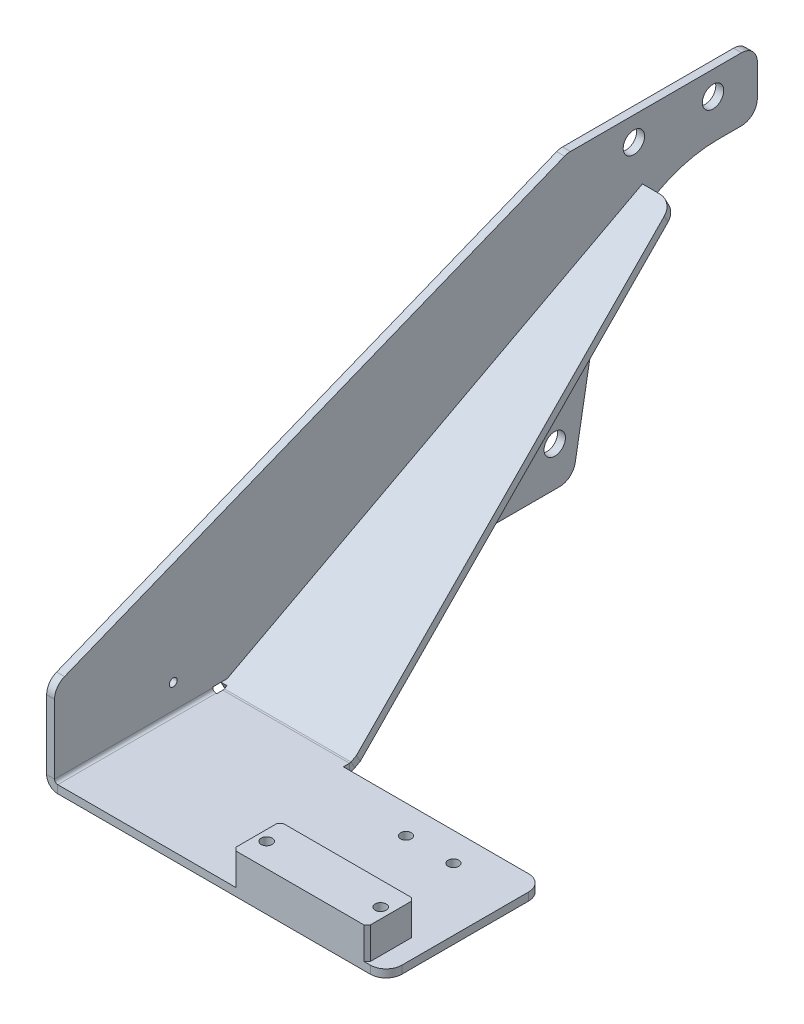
ISO-10303-21;
HEADER;
FILE_DESCRIPTION(('STEP AP214'),'2;1');
FILE_NAME('part.step','',(''),(''),'','','');
FILE_SCHEMA(('AUTOMOTIVE_DESIGN { 1 0 10303 214 1 1 1 1 }'));
ENDSEC;
DATA;
#1=APPLICATION_CONTEXT('core data for automotive mechanical design processes');
#2=APPLICATION_PROTOCOL_DEFINITION('international standard','automotive_design',2000,#1);
#3=PRODUCT_CONTEXT('',#1,'mechanical');
#4=PRODUCT('Part','Part','',(#3));
#5=PRODUCT_RELATED_PRODUCT_CATEGORY('part','',(#4));
#6=PRODUCT_DEFINITION_FORMATION('','',#4);
#7=PRODUCT_DEFINITION_CONTEXT('part definition',#1,'design');
#8=PRODUCT_DEFINITION('design','',#6,#7);
#9=PRODUCT_DEFINITION_SHAPE('','',#8);
#10=(LENGTH_UNIT() NAMED_UNIT(*) SI_UNIT(.MILLI.,.METRE.));
#11=(NAMED_UNIT(*) PLANE_ANGLE_UNIT() SI_UNIT($,.RADIAN.));
#12=(NAMED_UNIT(*) SI_UNIT($,.STERADIAN.) SOLID_ANGLE_UNIT());
#13=UNCERTAINTY_MEASURE_WITH_UNIT(LENGTH_MEASURE(1.E-05),#10,'distance_accuracy_value','');
#14=(GEOMETRIC_REPRESENTATION_CONTEXT(3) GLOBAL_UNCERTAINTY_ASSIGNED_CONTEXT((#13)) GLOBAL_UNIT_ASSIGNED_CONTEXT((#10,
#11,#12)) REPRESENTATION_CONTEXT('',''));
#15=CARTESIAN_POINT('',(0.,0.,0.));
#16=DIRECTION('',(0.,0.,1.));
#17=DIRECTION('',(1.,0.,0.));
#18=AXIS2_PLACEMENT_3D('',#15,#16,#17);
#19=CARTESIAN_POINT('',(209.465708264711,-92.4657082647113,444.));
#20=DIRECTION('',(0.,1.,0.));
#21=DIRECTION('',(0.,0.,-1.));
#22=AXIS2_PLACEMENT_3D('',#19,#20,#21);
#23=PLANE('',#22);
#24=CARTESIAN_POINT('',(191.,-92.4657083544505,429.));
#25=DIRECTION('',(0.,1.,0.));
#26=DIRECTION('',(0.,0.,1.));
#27=AXIS2_PLACEMENT_3D('',#24,#25,#26);
#28=CIRCLE('',#27,3.5);
#29=CARTESIAN_POINT('',(191.,-92.4657083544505,432.5));
#30=VERTEX_POINT('',#29);
#31=EDGE_CURVE('E620',#30,#30,#28,.T.);
#32=ORIENTED_EDGE('',*,*,#31,.T.);
#33=EDGE_LOOP('',(#32));
#34=FACE_BOUND('',#33,.T.);
#35=CARTESIAN_POINT('',(119.,-92.4657083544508,429.));
#36=DIRECTION('',(0.,1.,0.));
#37=DIRECTION('',(0.,0.,1.));
#38=AXIS2_PLACEMENT_3D('',#35,#36,#37);
#39=CIRCLE('',#38,3.5);
#40=CARTESIAN_POINT('',(119.,-92.4657083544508,432.5));
#41=VERTEX_POINT('',#40);
#42=EDGE_CURVE('E623',#41,#41,#39,.T.);
#43=ORIENTED_EDGE('',*,*,#42,.T.);
#44=EDGE_LOOP('',(#43));
#45=FACE_BOUND('',#44,.T.);
#46=CARTESIAN_POINT('',(140.,-92.4657083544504,362.));
#47=DIRECTION('',(0.,1.,0.));
#48=DIRECTION('',(0.,0.,1.));
#49=AXIS2_PLACEMENT_3D('',#46,#47,#48);
#50=CIRCLE('',#49,3.4);
#51=CARTESIAN_POINT('',(140.,-92.4657083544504,365.4));
#52=VERTEX_POINT('',#51);
#53=EDGE_CURVE('E629',#52,#52,#50,.T.);
#54=ORIENTED_EDGE('',*,*,#53,.T.);
#55=EDGE_LOOP('',(#54));
#56=FACE_BOUND('',#55,.T.);
#57=CARTESIAN_POINT('',(170.,-92.4657083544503,362.));
#58=DIRECTION('',(0.,1.,0.));
#59=DIRECTION('',(0.,0.,1.));
#60=AXIS2_PLACEMENT_3D('',#57,#58,#59);
#61=CIRCLE('',#60,3.4);
#62=CARTESIAN_POINT('',(170.,-92.4657083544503,365.4));
#63=VERTEX_POINT('',#62);
#64=EDGE_CURVE('E635',#63,#63,#61,.T.);
#65=ORIENTED_EDGE('',*,*,#64,.T.);
#66=EDGE_LOOP('',(#65));
#67=FACE_BOUND('',#66,.T.);
#68=DIRECTION('',(0.,0.,-1.));
#69=VECTOR('',#68,1.);
#70=CARTESIAN_POINT('',(209.465708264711,-92.4657082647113,444.));
#71=LINE('',#70,#69);
#72=CARTESIAN_POINT('',(209.465708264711,-92.4657082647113,434.));
#73=VERTEX_POINT('',#72);
#74=CARTESIAN_POINT('',(209.465708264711,-92.4657082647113,354.));
#75=VERTEX_POINT('',#74);
#76=EDGE_CURVE('E407',#73,#75,#71,.T.);
#77=ORIENTED_EDGE('',*,*,#76,.F.);
#78=CARTESIAN_POINT('',(199.465708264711,-92.4657082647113,434.));
#79=DIRECTION('',(0.,1.,0.));
#80=DIRECTION('',(-1.,0.,0.));
#81=AXIS2_PLACEMENT_3D('',#78,#79,#80);
#82=CIRCLE('',#81,10.);
#83=CARTESIAN_POINT('',(199.465708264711,-92.4657082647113,444.));
#84=VERTEX_POINT('',#83);
#85=EDGE_CURVE('E552',#73,#84,#82,.F.);
#86=ORIENTED_EDGE('',*,*,#85,.T.);
#87=DIRECTION('',(1.,0.,0.));
#88=VECTOR('',#87,1.);
#89=CARTESIAN_POINT('',(-185.534291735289,-92.4657082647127,444.));
#90=LINE('',#89,#88);
#91=CARTESIAN_POINT('',(2.00000000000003,-92.465708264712,444.));
#92=VERTEX_POINT('',#91);
#93=EDGE_CURVE('E410',#92,#84,#90,.T.);
#94=ORIENTED_EDGE('',*,*,#93,.F.);
#95=DIRECTION('',(0.,0.,-1.));
#96=VECTOR('',#95,1.);
#97=CARTESIAN_POINT('',(2.00000000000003,-92.465708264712,444.));
#98=LINE('',#97,#96);
#99=CARTESIAN_POINT('',(2.00000000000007,-92.4657083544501,344.));
#100=VERTEX_POINT('',#99);
#101=EDGE_CURVE('E423',#92,#100,#98,.T.);
#102=ORIENTED_EDGE('',*,*,#101,.T.);
#103=DIRECTION('',(-1.,0.,0.));
#104=VECTOR('',#103,1.);
#105=CARTESIAN_POINT('',(-5.53429173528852,-92.4657082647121,344.));
#106=LINE('',#105,#104);
#107=CARTESIAN_POINT('',(2.46570826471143,-92.465708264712,344.));
#108=VERTEX_POINT('',#107);
#109=EDGE_CURVE('E427',#108,#100,#106,.T.);
#110=ORIENTED_EDGE('',*,*,#109,.F.);
#111=DIRECTION('',(0.,0.,1.));
#112=VECTOR('',#111,1.);
#113=CARTESIAN_POINT('',(2.46570826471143,-92.465708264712,344.));
#114=LINE('',#113,#112);
#115=CARTESIAN_POINT('',(2.46570826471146,-92.465708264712,340.099557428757));
#116=VERTEX_POINT('',#115);
#117=EDGE_CURVE('E441',#116,#108,#114,.T.);
#118=ORIENTED_EDGE('',*,*,#117,.F.);
#119=DIRECTION('',(1.,0.,0.));
#120=VECTOR('',#119,1.);
#121=CARTESIAN_POINT('',(209.465708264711,-92.4657082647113,340.099557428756));
#122=LINE('',#121,#120);
#123=CARTESIAN_POINT('',(82.4657082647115,-92.4657080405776,340.099557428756));
#124=VERTEX_POINT('',#123);
#125=EDGE_CURVE('E439',#116,#124,#122,.T.);
#126=ORIENTED_EDGE('',*,*,#125,.T.);
#127=DIRECTION('',(0.,0.,-1.));
#128=VECTOR('',#127,1.);
#129=CARTESIAN_POINT('',(82.4657082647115,-92.4657082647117,334.));
#130=LINE('',#129,#128);
#131=CARTESIAN_POINT('',(82.4657082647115,-92.4657082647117,344.));
#132=VERTEX_POINT('',#131);
#133=EDGE_CURVE('E412',#132,#124,#130,.T.);
#134=ORIENTED_EDGE('',*,*,#133,.F.);
#135=DIRECTION('',(-1.,0.,0.));
#136=VECTOR('',#135,1.);
#137=CARTESIAN_POINT('',(82.4657082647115,-92.4657082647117,344.));
#138=LINE('',#137,#136);
#139=CARTESIAN_POINT('',(199.465708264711,-92.4657082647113,344.));
#140=VERTEX_POINT('',#139);
#141=EDGE_CURVE('E409',#140,#132,#138,.T.);
#142=ORIENTED_EDGE('',*,*,#141,.F.);
#143=CARTESIAN_POINT('',(199.465708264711,-92.4657082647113,354.));
#144=DIRECTION('',(0.,1.,0.));
#145=DIRECTION('',(-1.,0.,0.));
#146=AXIS2_PLACEMENT_3D('',#143,#144,#145);
#147=CIRCLE('',#146,10.);
#148=EDGE_CURVE('E40',#140,#75,#147,.F.);
#149=ORIENTED_EDGE('',*,*,#148,.T.);
#150=EDGE_LOOP('',(#77,#86,#94,#102,#110,#118,#126,#134,#142,#149));
#151=FACE_BOUND('',#150,.T.);
#152=ADVANCED_FACE('F16',(#34,#45,#56,#67,#151),#23,.F.);
#153=CARTESIAN_POINT('',(-185.534291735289,-92.4657082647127,444.));
#154=DIRECTION('',(0.,0.,1.));
#155=DIRECTION('',(1.,0.,0.));
#156=AXIS2_PLACEMENT_3D('',#153,#154,#155);
#157=PLANE('',#156);
#158=ORIENTED_EDGE('',*,*,#93,.T.);
#159=DIRECTION('',(0.,1.,0.));
#160=VECTOR('',#159,1.);
#161=CARTESIAN_POINT('',(199.465708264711,-92.4657082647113,444.));
#162=LINE('',#161,#160);
#163=CARTESIAN_POINT('',(199.465708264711,-87.4657082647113,444.));
#164=VERTEX_POINT('',#163);
#165=EDGE_CURVE('E539',#84,#164,#162,.T.);
#166=ORIENTED_EDGE('',*,*,#165,.T.);
#167=DIRECTION('',(1.,0.,0.));
#168=VECTOR('',#167,1.);
#169=CARTESIAN_POINT('',(-185.534291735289,-87.4657082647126,444.));
#170=LINE('',#169,#168);
#171=CARTESIAN_POINT('',(195.5,-87.4657082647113,444.));
#172=VERTEX_POINT('',#171);
#173=EDGE_CURVE('E343',#172,#164,#170,.T.);
#174=ORIENTED_EDGE('',*,*,#173,.F.);
#175=DIRECTION('',(0.,1.,0.));
#176=VECTOR('',#175,1.);
#177=CARTESIAN_POINT('',(195.5,-92.4657082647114,444.));
#178=LINE('',#177,#176);
#179=CARTESIAN_POINT('',(195.5,-67.4657082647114,444.));
#180=VERTEX_POINT('',#179);
#181=EDGE_CURVE('E481',#172,#180,#178,.T.);
#182=ORIENTED_EDGE('',*,*,#181,.T.);
#183=DIRECTION('',(-1.,0.,0.));
#184=VECTOR('',#183,1.);
#185=CARTESIAN_POINT('',(112.5,-67.4657082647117,444.));
#186=LINE('',#185,#184);
#187=CARTESIAN_POINT('',(114.5,-67.4657082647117,444.));
#188=VERTEX_POINT('',#187);
#189=EDGE_CURVE('E604',#180,#188,#186,.T.);
#190=ORIENTED_EDGE('',*,*,#189,.T.);
#191=DIRECTION('',(0.,-1.,0.));
#192=VECTOR('',#191,1.);
#193=CARTESIAN_POINT('',(114.5,-92.4657082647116,444.));
#194=LINE('',#193,#192);
#195=CARTESIAN_POINT('',(114.5,-87.4657082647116,444.));
#196=VERTEX_POINT('',#195);
#197=EDGE_CURVE('E483',#188,#196,#194,.T.);
#198=ORIENTED_EDGE('',*,*,#197,.T.);
#199=CARTESIAN_POINT('',(2.,-87.465708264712,444.));
#200=VERTEX_POINT('',#199);
#201=EDGE_CURVE('E417',#200,#196,#170,.T.);
#202=ORIENTED_EDGE('',*,*,#201,.F.);
#203=DIRECTION('',(0.,1.,0.));
#204=VECTOR('',#203,1.);
#205=CARTESIAN_POINT('',(2.,-92.465708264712,444.));
#206=LINE('',#205,#204);
#207=EDGE_CURVE('E430',#92,#200,#206,.T.);
#208=ORIENTED_EDGE('',*,*,#207,.F.);
#209=EDGE_LOOP('',(#158,#166,#174,#182,#190,#198,#202,#208));
#210=FACE_BOUND('',#209,.T.);
#211=ADVANCED_FACE('F785',(#210),#157,.T.);
#212=CARTESIAN_POINT('',(-5.53429173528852,-92.4657082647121,344.));
#213=DIRECTION('',(0.,0.,-1.));
#214=DIRECTION('',(-1.,0.,0.));
#215=AXIS2_PLACEMENT_3D('',#212,#213,#214);
#216=PLANE('',#215);
#217=DIRECTION('',(0.,-1.,0.));
#218=VECTOR('',#217,1.);
#219=CARTESIAN_POINT('',(2.,-92.465708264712,344.));
#220=LINE('',#219,#218);
#221=CARTESIAN_POINT('',(2.00000000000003,-87.465708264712,344.));
#222=VERTEX_POINT('',#221);
#223=EDGE_CURVE('E436',#222,#100,#220,.T.);
#224=ORIENTED_EDGE('',*,*,#223,.F.);
#225=DIRECTION('',(-1.,0.,0.));
#226=VECTOR('',#225,1.);
#227=CARTESIAN_POINT('',(-5.53429173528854,-87.465708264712,344.));
#228=LINE('',#227,#226);
#229=CARTESIAN_POINT('',(2.46570826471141,-87.465708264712,344.));
#230=VERTEX_POINT('',#229);
#231=EDGE_CURVE('E442',#230,#222,#228,.T.);
#232=ORIENTED_EDGE('',*,*,#231,.F.);
#233=DIRECTION('',(0.,1.,0.));
#234=VECTOR('',#233,1.);
#235=CARTESIAN_POINT('',(2.46570826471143,-92.465708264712,344.));
#236=LINE('',#235,#234);
#237=EDGE_CURVE('E420',#108,#230,#236,.T.);
#238=ORIENTED_EDGE('',*,*,#237,.F.);
#239=ORIENTED_EDGE('',*,*,#109,.T.);
#240=EDGE_LOOP('',(#224,#232,#238,#239));
#241=FACE_BOUND('',#240,.T.);
#242=ADVANCED_FACE('F737',(#241),#216,.T.);
#243=CARTESIAN_POINT('',(2.46570826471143,-92.465708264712,344.));
#244=DIRECTION('',(-1.,0.,0.));
#245=DIRECTION('',(0.,0.,1.));
#246=AXIS2_PLACEMENT_3D('',#243,#244,#245);
#247=PLANE('',#246);
#248=DIRECTION('',(0.,1.,0.));
#249=VECTOR('',#248,1.);
#250=CARTESIAN_POINT('',(2.46570826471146,-92.465708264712,340.099557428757));
#251=LINE('',#250,#249);
#252=CARTESIAN_POINT('',(2.46570826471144,-87.465708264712,340.099557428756));
#253=VERTEX_POINT('',#252);
#254=EDGE_CURVE('E450',#116,#253,#251,.T.);
#255=ORIENTED_EDGE('',*,*,#254,.F.);
#256=ORIENTED_EDGE('',*,*,#117,.T.);
#257=ORIENTED_EDGE('',*,*,#237,.T.);
#258=DIRECTION('',(0.,0.,1.));
#259=VECTOR('',#258,1.);
#260=CARTESIAN_POINT('',(2.46570826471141,-87.465708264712,344.));
#261=LINE('',#260,#259);
#262=EDGE_CURVE('E444',#253,#230,#261,.T.);
#263=ORIENTED_EDGE('',*,*,#262,.F.);
#264=EDGE_LOOP('',(#255,#256,#257,#263));
#265=FACE_BOUND('',#264,.T.);
#266=ADVANCED_FACE('F731',(#265),#247,.T.);
#267=CARTESIAN_POINT('',(82.4657082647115,-92.4657082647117,334.));
#268=DIRECTION('',(1.,0.,0.));
#269=DIRECTION('',(0.,0.,-1.));
#270=AXIS2_PLACEMENT_3D('',#267,#268,#269);
#271=PLANE('',#270);
#272=DIRECTION('',(0.,-1.,0.));
#273=VECTOR('',#272,1.);
#274=CARTESIAN_POINT('',(82.4657082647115,-92.4657082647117,340.099557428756));
#275=LINE('',#274,#273);
#276=CARTESIAN_POINT('',(82.4657082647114,-87.4657082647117,340.099557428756));
#277=VERTEX_POINT('',#276);
#278=EDGE_CURVE('E456',#277,#124,#275,.T.);
#279=ORIENTED_EDGE('',*,*,#278,.F.);
#280=DIRECTION('',(0.,0.,-1.));
#281=VECTOR('',#280,1.);
#282=CARTESIAN_POINT('',(82.4657082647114,-87.4657082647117,334.));
#283=LINE('',#282,#281);
#284=CARTESIAN_POINT('',(82.4657082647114,-87.4657082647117,344.));
#285=VERTEX_POINT('',#284);
#286=EDGE_CURVE('E419',#285,#277,#283,.T.);
#287=ORIENTED_EDGE('',*,*,#286,.F.);
#288=DIRECTION('',(0.,1.,0.));
#289=VECTOR('',#288,1.);
#290=CARTESIAN_POINT('',(82.4657082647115,-92.4657082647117,344.));
#291=LINE('',#290,#289);
#292=EDGE_CURVE('E424',#132,#285,#291,.T.);
#293=ORIENTED_EDGE('',*,*,#292,.F.);
#294=ORIENTED_EDGE('',*,*,#133,.T.);
#295=EDGE_LOOP('',(#279,#287,#293,#294));
#296=FACE_BOUND('',#295,.T.);
#297=ADVANCED_FACE('F798',(#296),#271,.T.);
#298=CARTESIAN_POINT('',(82.4657082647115,-92.4657082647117,344.));
#299=DIRECTION('',(0.,0.,-1.));
#300=DIRECTION('',(-1.,0.,0.));
#301=AXIS2_PLACEMENT_3D('',#298,#299,#300);
#302=PLANE('',#301);
#303=DIRECTION('',(-1.,0.,0.));
#304=VECTOR('',#303,1.);
#305=CARTESIAN_POINT('',(82.4657082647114,-87.4657082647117,344.));
#306=LINE('',#305,#304);
#307=CARTESIAN_POINT('',(199.465708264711,-87.4657082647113,344.));
#308=VERTEX_POINT('',#307);
#309=EDGE_CURVE('E416',#308,#285,#306,.T.);
#310=ORIENTED_EDGE('',*,*,#309,.F.);
#311=DIRECTION('',(0.,1.,0.));
#312=VECTOR('',#311,1.);
#313=CARTESIAN_POINT('',(199.465708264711,-92.4657082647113,344.));
#314=LINE('',#313,#312);
#315=EDGE_CURVE('E33',#308,#140,#314,.F.);
#316=ORIENTED_EDGE('',*,*,#315,.T.);
#317=ORIENTED_EDGE('',*,*,#141,.T.);
#318=ORIENTED_EDGE('',*,*,#292,.T.);
#319=EDGE_LOOP('',(#310,#316,#317,#318));
#320=FACE_BOUND('',#319,.T.);
#321=ADVANCED_FACE('F805',(#320),#302,.T.);
#322=CARTESIAN_POINT('',(209.465708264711,-92.4657082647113,444.));
#323=DIRECTION('',(1.,0.,0.));
#324=DIRECTION('',(0.,0.,-1.));
#325=AXIS2_PLACEMENT_3D('',#322,#323,#324);
#326=PLANE('',#325);
#327=DIRECTION('',(0.,0.,-1.));
#328=VECTOR('',#327,1.);
#329=CARTESIAN_POINT('',(209.465708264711,-87.4657082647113,444.));
#330=LINE('',#329,#328);
#331=CARTESIAN_POINT('',(209.465708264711,-87.4657082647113,434.));
#332=VERTEX_POINT('',#331);
#333=CARTESIAN_POINT('',(209.465708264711,-87.4657082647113,354.));
#334=VERTEX_POINT('',#333);
#335=EDGE_CURVE('E413',#332,#334,#330,.T.);
#336=ORIENTED_EDGE('',*,*,#335,.F.);
#337=DIRECTION('',(0.,1.,0.));
#338=VECTOR('',#337,1.);
#339=CARTESIAN_POINT('',(209.465708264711,-92.4657082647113,434.));
#340=LINE('',#339,#338);
#341=EDGE_CURVE('E549',#332,#73,#340,.F.);
#342=ORIENTED_EDGE('',*,*,#341,.T.);
#343=ORIENTED_EDGE('',*,*,#76,.T.);
#344=DIRECTION('',(0.,1.,0.));
#345=VECTOR('',#344,1.);
#346=CARTESIAN_POINT('',(209.465708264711,-92.4657082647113,354.));
#347=LINE('',#346,#345);
#348=EDGE_CURVE('E546',#75,#334,#347,.T.);
#349=ORIENTED_EDGE('',*,*,#348,.T.);
#350=EDGE_LOOP('',(#336,#342,#343,#349));
#351=FACE_BOUND('',#350,.T.);
#352=ADVANCED_FACE('F802',(#351),#326,.T.);
#353=CARTESIAN_POINT('',(209.465708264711,-87.4657082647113,444.));
#354=DIRECTION('',(0.,1.,0.));
#355=DIRECTION('',(0.,0.,-1.));
#356=AXIS2_PLACEMENT_3D('',#353,#354,#355);
#357=PLANE('',#356);
#358=ORIENTED_EDGE('',*,*,#173,.T.);
#359=CARTESIAN_POINT('',(199.465708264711,-87.4657082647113,434.));
#360=DIRECTION('',(0.,1.,0.));
#361=DIRECTION('',(-1.,0.,0.));
#362=AXIS2_PLACEMENT_3D('',#359,#360,#361);
#363=CIRCLE('',#362,10.);
#364=EDGE_CURVE('E544',#164,#332,#363,.T.);
#365=ORIENTED_EDGE('',*,*,#364,.T.);
#366=ORIENTED_EDGE('',*,*,#335,.T.);
#367=CARTESIAN_POINT('',(199.465708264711,-87.4657082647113,354.));
#368=DIRECTION('',(0.,1.,0.));
#369=DIRECTION('',(-1.,0.,0.));
#370=AXIS2_PLACEMENT_3D('',#367,#368,#369);
#371=CIRCLE('',#370,10.);
#372=EDGE_CURVE('E542',#334,#308,#371,.T.);
#373=ORIENTED_EDGE('',*,*,#372,.T.);
#374=ORIENTED_EDGE('',*,*,#309,.T.);
#375=ORIENTED_EDGE('',*,*,#286,.T.);
#376=DIRECTION('',(1.,0.,0.));
#377=VECTOR('',#376,1.);
#378=CARTESIAN_POINT('',(209.465708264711,-87.4657082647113,340.099557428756));
#379=LINE('',#378,#377);
#380=EDGE_CURVE('E453',#253,#277,#379,.T.);
#381=ORIENTED_EDGE('',*,*,#380,.F.);
#382=ORIENTED_EDGE('',*,*,#262,.T.);
#383=ORIENTED_EDGE('',*,*,#231,.T.);
#384=DIRECTION('',(0.,0.,-1.));
#385=VECTOR('',#384,1.);
#386=CARTESIAN_POINT('',(2.,-87.465708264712,444.));
#387=LINE('',#386,#385);
#388=EDGE_CURVE('E433',#200,#222,#387,.T.);
#389=ORIENTED_EDGE('',*,*,#388,.F.);
#390=ORIENTED_EDGE('',*,*,#201,.T.);
#391=DIRECTION('',(0.707106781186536,0.,0.707106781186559));
#392=VECTOR('',#391,1.);
#393=CARTESIAN_POINT('',(114.5,-87.4657082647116,444.));
#394=LINE('',#393,#392);
#395=CARTESIAN_POINT('',(112.5,-87.4657082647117,442.));
#396=VERTEX_POINT('',#395);
#397=EDGE_CURVE('E493',#196,#396,#394,.F.);
#398=ORIENTED_EDGE('',*,*,#397,.T.);
#399=DIRECTION('',(0.,0.,-1.));
#400=VECTOR('',#399,1.);
#401=CARTESIAN_POINT('',(112.5,-87.4657082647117,414.));
#402=LINE('',#401,#400);
#403=CARTESIAN_POINT('',(112.5,-87.4657082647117,416.));
#404=VERTEX_POINT('',#403);
#405=EDGE_CURVE('E593',#396,#404,#402,.T.);
#406=ORIENTED_EDGE('',*,*,#405,.T.);
#407=DIRECTION('',(-0.707106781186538,0.,0.707106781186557));
#408=VECTOR('',#407,1.);
#409=CARTESIAN_POINT('',(112.5,-87.4657082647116,416.));
#410=LINE('',#409,#408);
#411=CARTESIAN_POINT('',(114.5,-87.4657082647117,414.));
#412=VERTEX_POINT('',#411);
#413=EDGE_CURVE('E491',#404,#412,#410,.F.);
#414=ORIENTED_EDGE('',*,*,#413,.T.);
#415=DIRECTION('',(1.,0.,0.));
#416=VECTOR('',#415,1.);
#417=CARTESIAN_POINT('',(112.5,-87.4657082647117,414.));
#418=LINE('',#417,#416);
#419=CARTESIAN_POINT('',(195.5,-87.4657082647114,414.));
#420=VERTEX_POINT('',#419);
#421=EDGE_CURVE('E610',#412,#420,#418,.T.);
#422=ORIENTED_EDGE('',*,*,#421,.T.);
#423=DIRECTION('',(-0.707106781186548,0.,-0.707106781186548));
#424=VECTOR('',#423,1.);
#425=CARTESIAN_POINT('',(195.5,-87.4657082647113,414.));
#426=LINE('',#425,#424);
#427=CARTESIAN_POINT('',(197.5,-87.4657082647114,416.));
#428=VERTEX_POINT('',#427);
#429=EDGE_CURVE('E498',#420,#428,#426,.F.);
#430=ORIENTED_EDGE('',*,*,#429,.T.);
#431=DIRECTION('',(0.,0.,1.));
#432=VECTOR('',#431,1.);
#433=CARTESIAN_POINT('',(197.5,-87.4657082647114,414.));
#434=LINE('',#433,#432);
#435=CARTESIAN_POINT('',(197.5,-87.4657082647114,442.));
#436=VERTEX_POINT('',#435);
#437=EDGE_CURVE('E598',#428,#436,#434,.T.);
#438=ORIENTED_EDGE('',*,*,#437,.T.);
#439=DIRECTION('',(0.707106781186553,0.,-0.707106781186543));
#440=VECTOR('',#439,1.);
#441=CARTESIAN_POINT('',(197.5,-87.4657082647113,442.));
#442=LINE('',#441,#440);
#443=EDGE_CURVE('E495',#436,#172,#442,.F.);
#444=ORIENTED_EDGE('',*,*,#443,.T.);
#445=EDGE_LOOP('',(#358,#365,#366,#373,#374,#375,#381,#382,#383,#389,#390,#398,#406,#414,#422,
#430,#438,#444));
#446=FACE_BOUND('',#445,.T.);
#447=CARTESIAN_POINT('',(140.,-87.4657082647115,362.));
#448=DIRECTION('',(0.,1.,0.));
#449=DIRECTION('',(0.,0.,1.));
#450=AXIS2_PLACEMENT_3D('',#447,#448,#449);
#451=CIRCLE('',#450,3.4);
#452=CARTESIAN_POINT('',(140.,-87.4657082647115,365.4));
#453=VERTEX_POINT('',#452);
#454=EDGE_CURVE('E626',#453,#453,#451,.T.);
#455=ORIENTED_EDGE('',*,*,#454,.F.);
#456=EDGE_LOOP('',(#455));
#457=FACE_BOUND('',#456,.T.);
#458=CARTESIAN_POINT('',(170.,-87.4657082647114,362.));
#459=DIRECTION('',(0.,1.,0.));
#460=DIRECTION('',(0.,0.,1.));
#461=AXIS2_PLACEMENT_3D('',#458,#459,#460);
#462=CIRCLE('',#461,3.4);
#463=CARTESIAN_POINT('',(170.,-87.4657082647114,365.4));
#464=VERTEX_POINT('',#463);
#465=EDGE_CURVE('E632',#464,#464,#462,.T.);
#466=ORIENTED_EDGE('',*,*,#465,.F.);
#467=EDGE_LOOP('',(#466));
#468=FACE_BOUND('',#467,.T.);
#469=ADVANCED_FACE('F721',(#446,#457,#468),#357,.T.);
#470=CARTESIAN_POINT('',(-5.,-85.,344.));
#471=DIRECTION('',(0.,-1.,0.));
#472=DIRECTION('',(0.,0.,-1.));
#473=AXIS2_PLACEMENT_3D('',#470,#471,#472);
#474=PLANE('',#473);
#475=DIRECTION('',(0.,0.,-1.));
#476=VECTOR('',#475,1.);
#477=CARTESIAN_POINT('',(-5.,-85.,344.));
#478=LINE('',#477,#476);
#479=CARTESIAN_POINT('',(-5.,-85.,344.));
#480=VERTEX_POINT('',#479);
#481=CARTESIAN_POINT('',(-5.,-85.,124.890996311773));
#482=VERTEX_POINT('',#481);
#483=EDGE_CURVE('E403',#480,#482,#478,.T.);
#484=ORIENTED_EDGE('',*,*,#483,.T.);
#485=DIRECTION('',(1.,0.,0.));
#486=VECTOR('',#485,1.);
#487=CARTESIAN_POINT('',(0.,-85.,124.890996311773));
#488=LINE('',#487,#486);
#489=CARTESIAN_POINT('',(0.,-85.,124.890996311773));
#490=VERTEX_POINT('',#489);
#491=EDGE_CURVE('E555',#482,#490,#488,.T.);
#492=ORIENTED_EDGE('',*,*,#491,.T.);
#493=DIRECTION('',(0.,0.,-1.));
#494=VECTOR('',#493,1.);
#495=CARTESIAN_POINT('',(0.,-85.,344.));
#496=LINE('',#495,#494);
#497=CARTESIAN_POINT('',(0.,-85.,344.));
#498=VERTEX_POINT('',#497);
#499=EDGE_CURVE('E355',#498,#490,#496,.T.);
#500=ORIENTED_EDGE('',*,*,#499,.F.);
#501=DIRECTION('',(1.,0.,0.));
#502=VECTOR('',#501,1.);
#503=CARTESIAN_POINT('',(-5.,-85.,344.));
#504=LINE('',#503,#502);
#505=EDGE_CURVE('E340',#480,#498,#504,.T.);
#506=ORIENTED_EDGE('',*,*,#505,.F.);
#507=EDGE_LOOP('',(#484,#492,#500,#506));
#508=FACE_BOUND('',#507,.T.);
#509=ADVANCED_FACE('F801',(#508),#474,.T.);
#510=CARTESIAN_POINT('',(-5.,-11.1081457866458,103.470872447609));
#511=DIRECTION('',(0.,0.173648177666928,0.984807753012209));
#512=DIRECTION('',(0.,-0.984807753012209,0.173648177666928));
#513=AXIS2_PLACEMENT_3D('',#510,#511,#512);
#514=PLANE('',#513);
#515=DIRECTION('',(0.,-0.984807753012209,0.173648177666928));
#516=VECTOR('',#515,1.);
#517=CARTESIAN_POINT('',(0.,-11.1081457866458,103.470872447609));
#518=LINE('',#517,#516);
#519=CARTESIAN_POINT('',(0.,-11.1081457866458,103.470872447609));
#520=VERTEX_POINT('',#519);
#521=CARTESIAN_POINT('',(0.,-76.7364817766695,115.042918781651));
#522=VERTEX_POINT('',#521);
#523=EDGE_CURVE('E400',#520,#522,#518,.T.);
#524=ORIENTED_EDGE('',*,*,#523,.T.);
#525=DIRECTION('',(1.,0.,0.));
#526=VECTOR('',#525,1.);
#527=CARTESIAN_POINT('',(-5.,-76.7364817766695,115.042918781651));
#528=LINE('',#527,#526);
#529=CARTESIAN_POINT('',(-5.,-76.7364817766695,115.042918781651));
#530=VERTEX_POINT('',#529);
#531=EDGE_CURVE('E558',#522,#530,#528,.F.);
#532=ORIENTED_EDGE('',*,*,#531,.T.);
#533=DIRECTION('',(0.,-0.984807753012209,0.173648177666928));
#534=VECTOR('',#533,1.);
#535=CARTESIAN_POINT('',(-5.,-11.1081457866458,103.470872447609));
#536=LINE('',#535,#534);
#537=CARTESIAN_POINT('',(-5.,-11.1081457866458,103.470872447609));
#538=VERTEX_POINT('',#537);
#539=EDGE_CURVE('E370',#538,#530,#536,.T.);
#540=ORIENTED_EDGE('',*,*,#539,.F.);
#541=DIRECTION('',(1.,0.,0.));
#542=VECTOR('',#541,1.);
#543=CARTESIAN_POINT('',(-5.,-11.1081457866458,103.470872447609));
#544=LINE('',#543,#542);
#545=EDGE_CURVE('E398',#538,#520,#544,.T.);
#546=ORIENTED_EDGE('',*,*,#545,.T.);
#547=EDGE_LOOP('',(#524,#532,#540,#546));
#548=FACE_BOUND('',#547,.T.);
#549=ADVANCED_FACE('F878',(#548),#514,.F.);
#550=CARTESIAN_POINT('',(-5.,-25.,24.6862522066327));
#551=DIRECTION('',(1.,0.,0.));
#552=DIRECTION('',(0.,0.,-1.));
#553=AXIS2_PLACEMENT_3D('',#550,#551,#552);
#554=CYLINDRICAL_SURFACE('',#553,80.);
#555=CARTESIAN_POINT('',(0.,-25.,24.6862522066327));
#556=DIRECTION('',(1.,0.,0.));
#557=DIRECTION('',(0.,0.,1.));
#558=AXIS2_PLACEMENT_3D('',#555,#556,#557);
#559=CIRCLE('',#558,80.);
#560=CARTESIAN_POINT('',(0.,55.,24.6862522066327));
#561=VERTEX_POINT('',#560);
#562=EDGE_CURVE('E395',#561,#520,#559,.T.);
#563=ORIENTED_EDGE('',*,*,#562,.T.);
#564=ORIENTED_EDGE('',*,*,#545,.F.);
#565=CARTESIAN_POINT('',(-5.,-25.,24.6862522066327));
#566=DIRECTION('',(1.,0.,0.));
#567=DIRECTION('',(0.,0.,1.));
#568=AXIS2_PLACEMENT_3D('',#565,#566,#567);
#569=CIRCLE('',#568,80.);
#570=CARTESIAN_POINT('',(-5.,55.,24.6862522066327));
#571=VERTEX_POINT('',#570);
#572=EDGE_CURVE('E373',#571,#538,#569,.T.);
#573=ORIENTED_EDGE('',*,*,#572,.F.);
#574=DIRECTION('',(1.,0.,0.));
#575=VECTOR('',#574,1.);
#576=CARTESIAN_POINT('',(-5.,55.,24.6862522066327));
#577=LINE('',#576,#575);
#578=EDGE_CURVE('E392',#571,#561,#577,.T.);
#579=ORIENTED_EDGE('',*,*,#578,.T.);
#580=EDGE_LOOP('',(#563,#564,#573,#579));
#581=FACE_BOUND('',#580,.T.);
#582=ADVANCED_FACE('F868',(#581),#554,.F.);
#583=CARTESIAN_POINT('',(-5.,55.,0.));
#584=DIRECTION('',(0.,1.,0.));
#585=DIRECTION('',(0.,0.,1.));
#586=AXIS2_PLACEMENT_3D('',#583,#584,#585);
#587=PLANE('',#586);
#588=DIRECTION('',(0.,0.,1.));
#589=VECTOR('',#588,1.);
#590=CARTESIAN_POINT('',(-5.,55.,0.));
#591=LINE('',#590,#589);
#592=CARTESIAN_POINT('',(-5.,55.,10.));
#593=VERTEX_POINT('',#592);
#594=EDGE_CURVE('E376',#593,#571,#591,.T.);
#595=ORIENTED_EDGE('',*,*,#594,.F.);
#596=DIRECTION('',(1.,0.,0.));
#597=VECTOR('',#596,1.);
#598=CARTESIAN_POINT('',(0.,55.,10.));
#599=LINE('',#598,#597);
#600=CARTESIAN_POINT('',(0.,55.,10.));
#601=VERTEX_POINT('',#600);
#602=EDGE_CURVE('E560',#593,#601,#599,.T.);
#603=ORIENTED_EDGE('',*,*,#602,.T.);
#604=DIRECTION('',(0.,0.,1.));
#605=VECTOR('',#604,1.);
#606=CARTESIAN_POINT('',(0.,55.,0.));
#607=LINE('',#606,#605);
#608=EDGE_CURVE('E390',#601,#561,#607,.T.);
#609=ORIENTED_EDGE('',*,*,#608,.T.);
#610=ORIENTED_EDGE('',*,*,#578,.F.);
#611=EDGE_LOOP('',(#595,#603,#609,#610));
#612=FACE_BOUND('',#611,.T.);
#613=ADVANCED_FACE('F863',(#612),#587,.F.);
#614=CARTESIAN_POINT('',(-5.,95.,0.));
#615=DIRECTION('',(0.,0.,-1.));
#616=DIRECTION('',(0.,1.,0.));
#617=AXIS2_PLACEMENT_3D('',#614,#615,#616);
#618=PLANE('',#617);
#619=DIRECTION('',(0.,1.,0.));
#620=VECTOR('',#619,1.);
#621=CARTESIAN_POINT('',(0.,95.,0.));
#622=LINE('',#621,#620);
#623=CARTESIAN_POINT('',(0.,65.,0.));
#624=VERTEX_POINT('',#623);
#625=CARTESIAN_POINT('',(0.,85.,0.));
#626=VERTEX_POINT('',#625);
#627=EDGE_CURVE('E352',#624,#626,#622,.T.);
#628=ORIENTED_EDGE('',*,*,#627,.F.);
#629=DIRECTION('',(1.,0.,0.));
#630=VECTOR('',#629,1.);
#631=CARTESIAN_POINT('',(-5.,65.,0.));
#632=LINE('',#631,#630);
#633=CARTESIAN_POINT('',(-5.,65.,0.));
#634=VERTEX_POINT('',#633);
#635=EDGE_CURVE('E11',#624,#634,#632,.F.);
#636=ORIENTED_EDGE('',*,*,#635,.T.);
#637=DIRECTION('',(0.,1.,0.));
#638=VECTOR('',#637,1.);
#639=CARTESIAN_POINT('',(-5.,95.,0.));
#640=LINE('',#639,#638);
#641=CARTESIAN_POINT('',(-5.,85.,0.));
#642=VERTEX_POINT('',#641);
#643=EDGE_CURVE('E387',#634,#642,#640,.T.);
#644=ORIENTED_EDGE('',*,*,#643,.T.);
#645=DIRECTION('',(1.,0.,0.));
#646=VECTOR('',#645,1.);
#647=CARTESIAN_POINT('',(-5.,85.,0.));
#648=LINE('',#647,#646);
#649=EDGE_CURVE('E25',#642,#626,#648,.T.);
#650=ORIENTED_EDGE('',*,*,#649,.T.);
#651=EDGE_LOOP('',(#628,#636,#644,#650));
#652=FACE_BOUND('',#651,.T.);
#653=ADVANCED_FACE('F881',(#652),#618,.T.);
#654=CARTESIAN_POINT('',(-5.,95.,444.));
#655=DIRECTION('',(0.,1.,0.));
#656=DIRECTION('',(0.,0.,1.));
#657=AXIS2_PLACEMENT_3D('',#654,#655,#656);
#658=PLANE('',#657);
#659=DIRECTION('',(0.,0.,1.));
#660=VECTOR('',#659,1.);
#661=CARTESIAN_POINT('',(-5.,95.,444.));
#662=LINE('',#661,#660);
#663=CARTESIAN_POINT('',(-5.,95.,10.));
#664=VERTEX_POINT('',#663);
#665=CARTESIAN_POINT('',(-5.,95.,118.068658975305));
#666=VERTEX_POINT('',#665);
#667=EDGE_CURVE('E384',#664,#666,#662,.T.);
#668=ORIENTED_EDGE('',*,*,#667,.T.);
#669=DIRECTION('',(1.,0.,0.));
#670=VECTOR('',#669,1.);
#671=CARTESIAN_POINT('',(0.,95.,118.068658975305));
#672=LINE('',#671,#670);
#673=CARTESIAN_POINT('',(0.,95.,118.068658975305));
#674=VERTEX_POINT('',#673);
#675=EDGE_CURVE('E509',#666,#674,#672,.T.);
#676=ORIENTED_EDGE('',*,*,#675,.T.);
#677=DIRECTION('',(0.,0.,1.));
#678=VECTOR('',#677,1.);
#679=CARTESIAN_POINT('',(0.,95.,444.));
#680=LINE('',#679,#678);
#681=CARTESIAN_POINT('',(0.,95.,10.));
#682=VERTEX_POINT('',#681);
#683=EDGE_CURVE('E349',#682,#674,#680,.T.);
#684=ORIENTED_EDGE('',*,*,#683,.F.);
#685=DIRECTION('',(1.,0.,0.));
#686=VECTOR('',#685,1.);
#687=CARTESIAN_POINT('',(-5.,95.,10.));
#688=LINE('',#687,#686);
#689=EDGE_CURVE('E507',#682,#664,#688,.F.);
#690=ORIENTED_EDGE('',*,*,#689,.T.);
#691=EDGE_LOOP('',(#668,#676,#684,#690));
#692=FACE_BOUND('',#691,.T.);
#693=ADVANCED_FACE('F887',(#692),#658,.T.);
#694=CARTESIAN_POINT('',(-5.,95.,120.));
#695=DIRECTION('',(0.,-0.928081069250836,-0.372378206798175));
#696=DIRECTION('',(0.,0.372378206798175,-0.928081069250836));
#697=AXIS2_PLACEMENT_3D('',#694,#695,#696);
#698=PLANE('',#697);
#699=DIRECTION('',(0.,0.372378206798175,-0.928081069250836));
#700=VECTOR('',#699,1.);
#701=CARTESIAN_POINT('',(0.,95.,120.));
#702=LINE('',#701,#700);
#703=CARTESIAN_POINT('',(0.,-32.4817644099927,437.723782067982));
#704=VERTEX_POINT('',#703);
#705=CARTESIAN_POINT('',(0.,94.2808106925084,121.792441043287));
#706=VERTEX_POINT('',#705);
#707=EDGE_CURVE('E381',#704,#706,#702,.T.);
#708=ORIENTED_EDGE('',*,*,#707,.T.);
#709=DIRECTION('',(1.,0.,0.));
#710=VECTOR('',#709,1.);
#711=CARTESIAN_POINT('',(-5.,94.2808106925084,121.792441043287));
#712=LINE('',#711,#710);
#713=CARTESIAN_POINT('',(-5.,94.2808106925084,121.792441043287));
#714=VERTEX_POINT('',#713);
#715=EDGE_CURVE('E525',#706,#714,#712,.F.);
#716=ORIENTED_EDGE('',*,*,#715,.T.);
#717=DIRECTION('',(0.,0.372378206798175,-0.928081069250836));
#718=VECTOR('',#717,1.);
#719=CARTESIAN_POINT('',(-5.,95.,120.));
#720=LINE('',#719,#718);
#721=CARTESIAN_POINT('',(-5.,-32.4817644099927,437.723782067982));
#722=VERTEX_POINT('',#721);
#723=EDGE_CURVE('E378',#722,#714,#720,.T.);
#724=ORIENTED_EDGE('',*,*,#723,.F.);
#725=DIRECTION('',(1.,0.,0.));
#726=VECTOR('',#725,1.);
#727=CARTESIAN_POINT('',(0.,-32.4817644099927,437.723782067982));
#728=LINE('',#727,#726);
#729=EDGE_CURVE('E522',#722,#704,#728,.T.);
#730=ORIENTED_EDGE('',*,*,#729,.T.);
#731=EDGE_LOOP('',(#708,#716,#724,#730));
#732=FACE_BOUND('',#731,.T.);
#733=ADVANCED_FACE('F894',(#732),#698,.F.);
#734=CARTESIAN_POINT('',(-5.,-300.,444.));
#735=DIRECTION('',(1.,0.,0.));
#736=DIRECTION('',(0.,0.,-1.));
#737=AXIS2_PLACEMENT_3D('',#734,#735,#736);
#738=PLANE('',#737);
#739=CARTESIAN_POINT('',(-5.,-70.,369.));
#740=DIRECTION('',(-1.,0.,0.));
#741=DIRECTION('',(0.,0.,1.));
#742=AXIS2_PLACEMENT_3D('',#739,#740,#741);
#743=CIRCLE('',#742,2.5);
#744=CARTESIAN_POINT('',(-5.,-70.,371.5));
#745=VERTEX_POINT('',#744);
#746=EDGE_CURVE('E1340',#745,#745,#743,.T.);
#747=ORIENTED_EDGE('',*,*,#746,.F.);
#748=EDGE_LOOP('',(#747));
#749=FACE_BOUND('',#748,.T.);
#750=CARTESIAN_POINT('',(-5.00000005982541,80.,28.));
#751=DIRECTION('',(1.,0.,0.));
#752=DIRECTION('',(0.,0.,-1.));
#753=AXIS2_PLACEMENT_3D('',#750,#751,#752);
#754=CIRCLE('',#753,6.75);
#755=CARTESIAN_POINT('',(-5.00000005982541,80.,21.25));
#756=VERTEX_POINT('',#755);
#757=EDGE_CURVE('E638',#756,#756,#754,.T.);
#758=ORIENTED_EDGE('',*,*,#757,.T.);
#759=EDGE_LOOP('',(#758));
#760=FACE_BOUND('',#759,.T.);
#761=CARTESIAN_POINT('',(-5.00000005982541,80.,78.));
#762=DIRECTION('',(1.,0.,0.));
#763=DIRECTION('',(0.,0.,-1.));
#764=AXIS2_PLACEMENT_3D('',#761,#762,#763);
#765=CIRCLE('',#764,6.75);
#766=CARTESIAN_POINT('',(-5.00000005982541,80.,71.25));
#767=VERTEX_POINT('',#766);
#768=EDGE_CURVE('E644',#767,#767,#765,.T.);
#769=ORIENTED_EDGE('',*,*,#768,.T.);
#770=EDGE_LOOP('',(#769));
#771=FACE_BOUND('',#770,.T.);
#772=CARTESIAN_POINT('',(-5.00000005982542,-60.,128.));
#773=DIRECTION('',(1.,0.,0.));
#774=DIRECTION('',(0.,0.,-1.));
#775=AXIS2_PLACEMENT_3D('',#772,#773,#774);
#776=CIRCLE('',#775,6.75);
#777=CARTESIAN_POINT('',(-5.00000005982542,-60.,121.25));
#778=VERTEX_POINT('',#777);
#779=EDGE_CURVE('E650',#778,#778,#776,.T.);
#780=ORIENTED_EDGE('',*,*,#779,.T.);
#781=EDGE_LOOP('',(#780));
#782=FACE_BOUND('',#781,.T.);
#783=ORIENTED_EDGE('',*,*,#723,.T.);
#784=CARTESIAN_POINT('',(-5.,85.,118.068658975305));
#785=DIRECTION('',(1.,0.,0.));
#786=DIRECTION('',(0.,0.,-1.));
#787=AXIS2_PLACEMENT_3D('',#784,#785,#786);
#788=CIRCLE('',#787,10.);
#789=EDGE_CURVE('E535',#714,#666,#788,.F.);
#790=ORIENTED_EDGE('',*,*,#789,.T.);
#791=ORIENTED_EDGE('',*,*,#667,.F.);
#792=CARTESIAN_POINT('',(-5.,85.,10.));
#793=DIRECTION('',(1.,0.,0.));
#794=DIRECTION('',(0.,0.,-1.));
#795=AXIS2_PLACEMENT_3D('',#792,#793,#794);
#796=CIRCLE('',#795,10.);
#797=EDGE_CURVE('E527',#664,#642,#796,.F.);
#798=ORIENTED_EDGE('',*,*,#797,.T.);
#799=ORIENTED_EDGE('',*,*,#643,.F.);
#800=CARTESIAN_POINT('',(-5.,65.,10.));
#801=DIRECTION('',(1.,0.,0.));
#802=DIRECTION('',(0.,0.,-1.));
#803=AXIS2_PLACEMENT_3D('',#800,#801,#802);
#804=CIRCLE('',#803,10.);
#805=EDGE_CURVE('E529',#634,#593,#804,.F.);
#806=ORIENTED_EDGE('',*,*,#805,.T.);
#807=ORIENTED_EDGE('',*,*,#594,.T.);
#808=ORIENTED_EDGE('',*,*,#572,.T.);
#809=ORIENTED_EDGE('',*,*,#539,.T.);
#810=CARTESIAN_POINT('',(-5.,-75.,124.890996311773));
#811=DIRECTION('',(1.,0.,0.));
#812=DIRECTION('',(0.,0.,-1.));
#813=AXIS2_PLACEMENT_3D('',#810,#811,#812);
#814=CIRCLE('',#813,10.);
#815=EDGE_CURVE('E531',#530,#482,#814,.F.);
#816=ORIENTED_EDGE('',*,*,#815,.T.);
#817=ORIENTED_EDGE('',*,*,#483,.F.);
#818=DIRECTION('',(0.,1.,0.));
#819=VECTOR('',#818,1.);
#820=CARTESIAN_POINT('',(-5.,-85.,344.));
#821=LINE('',#820,#819);
#822=CARTESIAN_POINT('',(-5.00000005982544,-85.465708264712,344.));
#823=VERTEX_POINT('',#822);
#824=EDGE_CURVE('E344',#823,#480,#821,.T.);
#825=ORIENTED_EDGE('',*,*,#824,.F.);
#826=DIRECTION('',(0.,0.,-1.));
#827=VECTOR('',#826,1.);
#828=CARTESIAN_POINT('',(-5.,-85.465708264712,444.));
#829=LINE('',#828,#827);
#830=CARTESIAN_POINT('',(-5.00000002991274,-85.465708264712,444.));
#831=VERTEX_POINT('',#830);
#832=EDGE_CURVE('E335',#831,#823,#829,.T.);
#833=ORIENTED_EDGE('',*,*,#832,.F.);
#834=DIRECTION('',(0.,-1.,0.));
#835=VECTOR('',#834,1.);
#836=CARTESIAN_POINT('',(-5.,95.,444.));
#837=LINE('',#836,#835);
#838=CARTESIAN_POINT('',(-5.,-41.762575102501,444.));
#839=VERTEX_POINT('',#838);
#840=EDGE_CURVE('E368',#839,#831,#837,.T.);
#841=ORIENTED_EDGE('',*,*,#840,.F.);
#842=CARTESIAN_POINT('',(-5.,-41.762575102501,434.));
#843=DIRECTION('',(1.,0.,0.));
#844=DIRECTION('',(0.,0.,-1.));
#845=AXIS2_PLACEMENT_3D('',#842,#843,#844);
#846=CIRCLE('',#845,10.);
#847=EDGE_CURVE('E533',#839,#722,#846,.F.);
#848=ORIENTED_EDGE('',*,*,#847,.T.);
#849=EDGE_LOOP('',(#783,#790,#791,#798,#799,#806,#807,#808,#809,#816,#817,#825,#833,#841,#848));
#850=FACE_BOUND('',#849,.T.);
#851=ADVANCED_FACE('F765',(#749,#760,#771,#782,#850),#738,.F.);
#852=CARTESIAN_POINT('',(-5.,95.,444.));
#853=DIRECTION('',(0.,0.,1.));
#854=DIRECTION('',(0.,-1.,0.));
#855=AXIS2_PLACEMENT_3D('',#852,#853,#854);
#856=PLANE('',#855);
#857=DIRECTION('',(0.,-1.,0.));
#858=VECTOR('',#857,1.);
#859=CARTESIAN_POINT('',(0.,95.,444.));
#860=LINE('',#859,#858);
#861=CARTESIAN_POINT('',(0.,-41.762575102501,444.));
#862=VERTEX_POINT('',#861);
#863=CARTESIAN_POINT('',(0.,-85.4657082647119,444.));
#864=VERTEX_POINT('',#863);
#865=EDGE_CURVE('E363',#862,#864,#860,.T.);
#866=ORIENTED_EDGE('',*,*,#865,.F.);
#867=DIRECTION('',(1.,0.,0.));
#868=VECTOR('',#867,1.);
#869=CARTESIAN_POINT('',(-5.,-41.762575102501,444.));
#870=LINE('',#869,#868);
#871=EDGE_CURVE('E537',#862,#839,#870,.F.);
#872=ORIENTED_EDGE('',*,*,#871,.T.);
#873=ORIENTED_EDGE('',*,*,#840,.T.);
#874=DIRECTION('',(1.,0.,0.));
#875=VECTOR('',#874,1.);
#876=CARTESIAN_POINT('',(-5.,-85.4657082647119,444.));
#877=LINE('',#876,#875);
#878=EDGE_CURVE('E365',#831,#864,#877,.T.);
#879=ORIENTED_EDGE('',*,*,#878,.T.);
#880=EDGE_LOOP('',(#866,#872,#873,#879));
#881=FACE_BOUND('',#880,.T.);
#882=ADVANCED_FACE('F756',(#881),#856,.T.);
#883=CARTESIAN_POINT('',(0.,-300.,444.));
#884=DIRECTION('',(1.,0.,0.));
#885=DIRECTION('',(0.,0.,-1.));
#886=AXIS2_PLACEMENT_3D('',#883,#884,#885);
#887=PLANE('',#886);
#888=CARTESIAN_POINT('',(0.,-70.,369.));
#889=DIRECTION('',(1.,0.,0.));
#890=DIRECTION('',(0.,0.,-1.));
#891=AXIS2_PLACEMENT_3D('',#888,#889,#890);
#892=CIRCLE('',#891,2.49999999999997);
#893=CARTESIAN_POINT('',(0.,-70.,366.5));
#894=VERTEX_POINT('',#893);
#895=EDGE_CURVE('E20',#894,#894,#892,.T.);
#896=ORIENTED_EDGE('',*,*,#895,.F.);
#897=EDGE_LOOP('',(#896));
#898=FACE_BOUND('',#897,.T.);
#899=CARTESIAN_POINT('',(0.,80.,28.));
#900=DIRECTION('',(1.,0.,0.));
#901=DIRECTION('',(0.,0.,-1.));
#902=AXIS2_PLACEMENT_3D('',#899,#900,#901);
#903=CIRCLE('',#902,6.75);
#904=CARTESIAN_POINT('',(0.,80.,21.25));
#905=VERTEX_POINT('',#904);
#906=EDGE_CURVE('E641',#905,#905,#903,.T.);
#907=ORIENTED_EDGE('',*,*,#906,.F.);
#908=EDGE_LOOP('',(#907));
#909=FACE_BOUND('',#908,.T.);
#910=CARTESIAN_POINT('',(0.,80.,78.));
#911=DIRECTION('',(1.,0.,0.));
#912=DIRECTION('',(0.,0.,-1.));
#913=AXIS2_PLACEMENT_3D('',#910,#911,#912);
#914=CIRCLE('',#913,6.75);
#915=CARTESIAN_POINT('',(0.,80.,71.25));
#916=VERTEX_POINT('',#915);
#917=EDGE_CURVE('E647',#916,#916,#914,.T.);
#918=ORIENTED_EDGE('',*,*,#917,.F.);
#919=EDGE_LOOP('',(#918));
#920=FACE_BOUND('',#919,.T.);
#921=CARTESIAN_POINT('',(0.,-60.,128.));
#922=DIRECTION('',(1.,0.,0.));
#923=DIRECTION('',(0.,0.,-1.));
#924=AXIS2_PLACEMENT_3D('',#921,#922,#923);
#925=CIRCLE('',#924,6.75);
#926=CARTESIAN_POINT('',(0.,-60.,121.25));
#927=VERTEX_POINT('',#926);
#928=EDGE_CURVE('E312',#927,#927,#925,.T.);
#929=ORIENTED_EDGE('',*,*,#928,.F.);
#930=EDGE_LOOP('',(#929));
#931=FACE_BOUND('',#930,.T.);
#932=ORIENTED_EDGE('',*,*,#683,.T.);
#933=CARTESIAN_POINT('',(0.,85.,118.068658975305));
#934=DIRECTION('',(1.,0.,0.));
#935=DIRECTION('',(0.,0.,-1.));
#936=AXIS2_PLACEMENT_3D('',#933,#934,#935);
#937=CIRCLE('',#936,10.);
#938=EDGE_CURVE('E520',#674,#706,#937,.T.);
#939=ORIENTED_EDGE('',*,*,#938,.T.);
#940=ORIENTED_EDGE('',*,*,#707,.F.);
#941=CARTESIAN_POINT('',(0.,-41.762575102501,434.));
#942=DIRECTION('',(1.,0.,0.));
#943=DIRECTION('',(0.,0.,-1.));
#944=AXIS2_PLACEMENT_3D('',#941,#942,#943);
#945=CIRCLE('',#944,10.);
#946=EDGE_CURVE('E518',#704,#862,#945,.T.);
#947=ORIENTED_EDGE('',*,*,#946,.T.);
#948=ORIENTED_EDGE('',*,*,#865,.T.);
#949=DIRECTION('',(0.,0.,-1.));
#950=VECTOR('',#949,1.);
#951=CARTESIAN_POINT('',(0.,-85.465708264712,444.));
#952=LINE('',#951,#950);
#953=CARTESIAN_POINT('',(-5.98254015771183E-08,-85.465708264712,344.));
#954=VERTEX_POINT('',#953);
#955=EDGE_CURVE('E360',#864,#954,#952,.T.);
#956=ORIENTED_EDGE('',*,*,#955,.T.);
#957=DIRECTION('',(0.,1.,0.));
#958=VECTOR('',#957,1.);
#959=CARTESIAN_POINT('',(0.,-85.,344.));
#960=LINE('',#959,#958);
#961=EDGE_CURVE('E358',#954,#498,#960,.T.);
#962=ORIENTED_EDGE('',*,*,#961,.T.);
#963=ORIENTED_EDGE('',*,*,#499,.T.);
#964=CARTESIAN_POINT('',(0.,-75.,124.890996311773));
#965=DIRECTION('',(1.,0.,0.));
#966=DIRECTION('',(0.,0.,-1.));
#967=AXIS2_PLACEMENT_3D('',#964,#965,#966);
#968=CIRCLE('',#967,10.);
#969=EDGE_CURVE('E516',#490,#522,#968,.T.);
#970=ORIENTED_EDGE('',*,*,#969,.T.);
#971=ORIENTED_EDGE('',*,*,#523,.F.);
#972=ORIENTED_EDGE('',*,*,#562,.F.);
#973=ORIENTED_EDGE('',*,*,#608,.F.);
#974=CARTESIAN_POINT('',(0.,65.,10.));
#975=DIRECTION('',(1.,0.,0.));
#976=DIRECTION('',(0.,0.,-1.));
#977=AXIS2_PLACEMENT_3D('',#974,#975,#976);
#978=CIRCLE('',#977,10.);
#979=EDGE_CURVE('E514',#601,#624,#978,.T.);
#980=ORIENTED_EDGE('',*,*,#979,.T.);
#981=ORIENTED_EDGE('',*,*,#627,.T.);
#982=CARTESIAN_POINT('',(0.,85.,10.));
#983=DIRECTION('',(1.,0.,0.));
#984=DIRECTION('',(0.,0.,-1.));
#985=AXIS2_PLACEMENT_3D('',#982,#983,#984);
#986=CIRCLE('',#985,10.);
#987=EDGE_CURVE('E512',#626,#682,#986,.T.);
#988=ORIENTED_EDGE('',*,*,#987,.T.);
#989=EDGE_LOOP('',(#932,#939,#940,#947,#948,#956,#962,#963,#970,#971,#972,#973,#980,#981,#988));
#990=FACE_BOUND('',#989,.T.);
#991=ADVANCED_FACE('F876',(#898,#909,#920,#931,#990),#887,.T.);
#992=CARTESIAN_POINT('',(-5.,-85.,344.));
#993=DIRECTION('',(0.,0.,-1.));
#994=DIRECTION('',(0.,1.,0.));
#995=AXIS2_PLACEMENT_3D('',#992,#993,#994);
#996=PLANE('',#995);
#997=ORIENTED_EDGE('',*,*,#961,.F.);
#998=DIRECTION('',(-1.,0.,0.));
#999=VECTOR('',#998,1.);
#1000=CARTESIAN_POINT('',(-5.,-85.4657082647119,344.));
#1001=LINE('',#1000,#999);
#1002=EDGE_CURVE('E346',#954,#823,#1001,.T.);
#1003=ORIENTED_EDGE('',*,*,#1002,.T.);
#1004=ORIENTED_EDGE('',*,*,#824,.T.);
#1005=ORIENTED_EDGE('',*,*,#505,.T.);
#1006=EDGE_LOOP('',(#997,#1003,#1004,#1005));
#1007=FACE_BOUND('',#1006,.T.);
#1008=ADVANCED_FACE('F770',(#1007),#996,.T.);
#1009=CARTESIAN_POINT('',(2.0000000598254,-85.465708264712,444.));
#1010=DIRECTION('',(0.,0.,1.));
#1011=DIRECTION('',(1.,0.,0.));
#1012=AXIS2_PLACEMENT_3D('',#1009,#1010,#1011);
#1013=PLANE('',#1012);
#1014=ORIENTED_EDGE('',*,*,#207,.T.);
#1015=CARTESIAN_POINT('',(2.,-85.465708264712,444.));
#1016=DIRECTION('',(0.,0.,1.));
#1017=DIRECTION('',(0.,-1.,0.));
#1018=AXIS2_PLACEMENT_3D('',#1015,#1016,#1017);
#1019=CIRCLE('',#1018,2.0000000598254);
#1020=EDGE_CURVE('E323',#200,#864,#1019,.F.);
#1021=ORIENTED_EDGE('',*,*,#1020,.T.);
#1022=ORIENTED_EDGE('',*,*,#878,.F.);
#1023=CARTESIAN_POINT('',(2.0000000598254,-85.465708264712,444.));
#1024=DIRECTION('',(0.,0.,-1.));
#1025=DIRECTION('',(1.,0.,0.));
#1026=AXIS2_PLACEMENT_3D('',#1023,#1024,#1025);
#1027=CIRCLE('',#1026,7.00000008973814);
#1028=EDGE_CURVE('E328',#92,#831,#1027,.T.);
#1029=ORIENTED_EDGE('',*,*,#1028,.F.);
#1030=EDGE_LOOP('',(#1014,#1021,#1022,#1029));
#1031=FACE_BOUND('',#1030,.T.);
#1032=ADVANCED_FACE('F746',(#1031),#1013,.T.);
#1033=CARTESIAN_POINT('',(2.0000000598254,-85.465708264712,344.));
#1034=DIRECTION('',(0.,0.,-1.));
#1035=DIRECTION('',(-1.,0.,0.));
#1036=AXIS2_PLACEMENT_3D('',#1033,#1034,#1035);
#1037=PLANE('',#1036);
#1038=ORIENTED_EDGE('',*,*,#1002,.F.);
#1039=CARTESIAN_POINT('',(2.,-85.465708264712,344.));
#1040=DIRECTION('',(0.,0.,1.));
#1041=DIRECTION('',(0.,-1.,0.));
#1042=AXIS2_PLACEMENT_3D('',#1039,#1040,#1041);
#1043=CIRCLE('',#1042,2.0000000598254);
#1044=EDGE_CURVE('E332',#954,#222,#1043,.T.);
#1045=ORIENTED_EDGE('',*,*,#1044,.T.);
#1046=ORIENTED_EDGE('',*,*,#223,.T.);
#1047=CARTESIAN_POINT('',(2.0000000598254,-85.465708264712,344.));
#1048=DIRECTION('',(0.,0.,1.));
#1049=DIRECTION('',(-1.,0.,0.));
#1050=AXIS2_PLACEMENT_3D('',#1047,#1048,#1049);
#1051=CIRCLE('',#1050,7.00000008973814);
#1052=EDGE_CURVE('E331',#823,#100,#1051,.T.);
#1053=ORIENTED_EDGE('',*,*,#1052,.F.);
#1054=EDGE_LOOP('',(#1038,#1045,#1046,#1053));
#1055=FACE_BOUND('',#1054,.T.);
#1056=ADVANCED_FACE('F772',(#1055),#1037,.T.);
#1057=CARTESIAN_POINT('',(2.,-85.465708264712,293.625875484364));
#1058=DIRECTION('',(0.,0.,1.));
#1059=DIRECTION('',(0.,-1.,0.));
#1060=AXIS2_PLACEMENT_3D('',#1057,#1058,#1059);
#1061=CYLINDRICAL_SURFACE('',#1060,7.00000005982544);
#1062=ORIENTED_EDGE('',*,*,#1052,.T.);
#1063=ORIENTED_EDGE('',*,*,#101,.F.);
#1064=ORIENTED_EDGE('',*,*,#1028,.T.);
#1065=ORIENTED_EDGE('',*,*,#832,.T.);
#1066=EDGE_LOOP('',(#1062,#1063,#1064,#1065));
#1067=FACE_BOUND('',#1066,.T.);
#1068=ADVANCED_FACE('F761',(#1067),#1061,.T.);
#1069=CARTESIAN_POINT('',(2.,-85.465708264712,293.625875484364));
#1070=DIRECTION('',(0.,0.,1.));
#1071=DIRECTION('',(0.,-1.,0.));
#1072=AXIS2_PLACEMENT_3D('',#1069,#1070,#1071);
#1073=CYLINDRICAL_SURFACE('',#1072,2.0000000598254);
#1074=ORIENTED_EDGE('',*,*,#1044,.F.);
#1075=ORIENTED_EDGE('',*,*,#955,.F.);
#1076=ORIENTED_EDGE('',*,*,#1020,.F.);
#1077=ORIENTED_EDGE('',*,*,#388,.T.);
#1078=EDGE_LOOP('',(#1074,#1075,#1076,#1077));
#1079=FACE_BOUND('',#1078,.T.);
#1080=ADVANCED_FACE('F751',(#1079),#1073,.F.);
#1081=CARTESIAN_POINT('',(2.46570826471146,-85.4657085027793,340.099557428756));
#1082=DIRECTION('',(-1.,0.,0.));
#1083=DIRECTION('',(0.,-1.,0.));
#1084=AXIS2_PLACEMENT_3D('',#1081,#1082,#1083);
#1085=PLANE('',#1084);
#1086=ORIENTED_EDGE('',*,*,#254,.T.);
#1087=CARTESIAN_POINT('',(2.46570826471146,-85.465708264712,340.099557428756));
#1088=DIRECTION('',(1.,0.,0.));
#1089=DIRECTION('',(0.,1.,0.));
#1090=AXIS2_PLACEMENT_3D('',#1087,#1088,#1089);
#1091=CIRCLE('',#1090,1.99999976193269);
#1092=CARTESIAN_POINT('',(2.46570826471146,-87.2316034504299,339.160614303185));
#1093=VERTEX_POINT('',#1092);
#1094=EDGE_CURVE('E301',#253,#1093,#1091,.T.);
#1095=ORIENTED_EDGE('',*,*,#1094,.T.);
#1096=DIRECTION('',(0.,0.882947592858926,0.469471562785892));
#1097=VECTOR('',#1096,1.);
#1098=CARTESIAN_POINT('',(2.46570826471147,-91.6463414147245,336.813256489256));
#1099=LINE('',#1098,#1097);
#1100=CARTESIAN_POINT('',(2.46570826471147,-91.6463414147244,336.813256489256));
#1101=VERTEX_POINT('',#1100);
#1102=EDGE_CURVE('E672',#1101,#1093,#1099,.T.);
#1103=ORIENTED_EDGE('',*,*,#1102,.F.);
#1104=CARTESIAN_POINT('',(2.46570826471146,-85.4657085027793,340.099557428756));
#1105=DIRECTION('',(1.,0.,0.));
#1106=DIRECTION('',(0.,-1.,0.));
#1107=AXIS2_PLACEMENT_3D('',#1104,#1105,#1106);
#1108=CIRCLE('',#1107,6.99999953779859);
#1109=EDGE_CURVE('E316',#116,#1101,#1108,.T.);
#1110=ORIENTED_EDGE('',*,*,#1109,.F.);
#1111=EDGE_LOOP('',(#1086,#1095,#1103,#1110));
#1112=FACE_BOUND('',#1111,.T.);
#1113=ADVANCED_FACE('F728',(#1112),#1085,.T.);
#1114=CARTESIAN_POINT('',(82.4657082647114,-85.465708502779,340.099557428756));
#1115=DIRECTION('',(1.,0.,0.));
#1116=DIRECTION('',(0.,1.,0.));
#1117=AXIS2_PLACEMENT_3D('',#1114,#1115,#1116);
#1118=PLANE('',#1117);
#1119=DIRECTION('',(0.,-0.882947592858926,-0.469471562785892));
#1120=VECTOR('',#1119,1.);
#1121=CARTESIAN_POINT('',(82.4657082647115,-91.6463414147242,336.813256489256));
#1122=LINE('',#1121,#1120);
#1123=CARTESIAN_POINT('',(82.4657082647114,-87.2316034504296,339.160614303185));
#1124=VERTEX_POINT('',#1123);
#1125=CARTESIAN_POINT('',(82.4657082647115,-91.6463412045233,336.813256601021));
#1126=VERTEX_POINT('',#1125);
#1127=EDGE_CURVE('E288',#1124,#1126,#1122,.T.);
#1128=ORIENTED_EDGE('',*,*,#1127,.F.);
#1129=CARTESIAN_POINT('',(82.4657082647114,-85.4657082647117,340.099557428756));
#1130=DIRECTION('',(1.,0.,0.));
#1131=DIRECTION('',(0.,1.,0.));
#1132=AXIS2_PLACEMENT_3D('',#1129,#1130,#1131);
#1133=CIRCLE('',#1132,1.99999976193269);
#1134=EDGE_CURVE('E320',#1124,#277,#1133,.F.);
#1135=ORIENTED_EDGE('',*,*,#1134,.T.);
#1136=ORIENTED_EDGE('',*,*,#278,.T.);
#1137=CARTESIAN_POINT('',(82.4657082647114,-85.465708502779,340.099557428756));
#1138=DIRECTION('',(-1.,0.,0.));
#1139=DIRECTION('',(0.,1.,0.));
#1140=AXIS2_PLACEMENT_3D('',#1137,#1138,#1139);
#1141=CIRCLE('',#1140,6.99999953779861);
#1142=EDGE_CURVE('E319',#1126,#124,#1141,.T.);
#1143=ORIENTED_EDGE('',*,*,#1142,.F.);
#1144=EDGE_LOOP('',(#1128,#1135,#1136,#1143));
#1145=FACE_BOUND('',#1144,.T.);
#1146=ADVANCED_FACE('F716',(#1145),#1118,.T.);
#1147=CARTESIAN_POINT('',(-37.7205505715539,-85.4657082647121,340.099557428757));
#1148=DIRECTION('',(1.,0.,0.));
#1149=DIRECTION('',(0.,1.,0.));
#1150=AXIS2_PLACEMENT_3D('',#1147,#1148,#1149);
#1151=CYLINDRICAL_SURFACE('',#1150,6.99999976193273);
#1152=ORIENTED_EDGE('',*,*,#1142,.T.);
#1153=ORIENTED_EDGE('',*,*,#125,.F.);
#1154=ORIENTED_EDGE('',*,*,#1109,.T.);
#1155=DIRECTION('',(1.,0.,0.));
#1156=VECTOR('',#1155,1.);
#1157=CARTESIAN_POINT('',(209.465708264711,-91.6463414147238,336.813256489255));
#1158=LINE('',#1157,#1156);
#1159=EDGE_CURVE('E308',#1101,#1126,#1158,.T.);
#1160=ORIENTED_EDGE('',*,*,#1159,.T.);
#1161=EDGE_LOOP('',(#1152,#1153,#1154,#1160));
#1162=FACE_BOUND('',#1161,.T.);
#1163=ADVANCED_FACE('F1012',(#1162),#1151,.T.);
#1164=CARTESIAN_POINT('',(-37.7205505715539,-85.4657082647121,340.099557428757));
#1165=DIRECTION('',(1.,0.,0.));
#1166=DIRECTION('',(0.,1.,0.));
#1167=AXIS2_PLACEMENT_3D('',#1164,#1165,#1166);
#1168=CYLINDRICAL_SURFACE('',#1167,1.99999976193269);
#1169=ORIENTED_EDGE('',*,*,#1134,.F.);
#1170=DIRECTION('',(1.,0.,0.));
#1171=VECTOR('',#1170,1.);
#1172=CARTESIAN_POINT('',(209.465708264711,-87.2316034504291,339.160614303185));
#1173=LINE('',#1172,#1171);
#1174=EDGE_CURVE('E667',#1093,#1124,#1173,.T.);
#1175=ORIENTED_EDGE('',*,*,#1174,.F.);
#1176=ORIENTED_EDGE('',*,*,#1094,.F.);
#1177=ORIENTED_EDGE('',*,*,#380,.T.);
#1178=EDGE_LOOP('',(#1169,#1175,#1176,#1177));
#1179=FACE_BOUND('',#1178,.T.);
#1180=ADVANCED_FACE('F717',(#1179),#1168,.F.);
#1181=CARTESIAN_POINT('',(19.1238528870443,50.0873311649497,70.2509874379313));
#1182=DIRECTION('',(0.978147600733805,0.0976086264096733,-0.18357512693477));
#1183=DIRECTION('',(-0.207911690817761,0.45921248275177,-0.863653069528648));
#1184=AXIS2_PLACEMENT_3D('',#1181,#1182,#1183);
#1185=PLANE('',#1184);
#1186=DIRECTION('',(-0.207911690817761,0.45921248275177,-0.863653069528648));
#1187=VECTOR('',#1186,1.);
#1188=CARTESIAN_POINT('',(19.1238528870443,50.0873311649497,70.2509874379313));
#1189=LINE('',#1188,#1187);
#1190=CARTESIAN_POINT('',(82.4657082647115,-89.8151945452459,333.369370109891));
#1191=VERTEX_POINT('',#1190);
#1192=CARTESIAN_POINT('',(20.8074885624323,46.3687018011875,77.2447120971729));
#1193=VERTEX_POINT('',#1192);
#1194=EDGE_CURVE('E297',#1191,#1193,#1189,.T.);
#1195=ORIENTED_EDGE('',*,*,#1194,.T.);
#1196=DIRECTION('',(0.,0.882947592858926,0.469471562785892));
#1197=VECTOR('',#1196,1.);
#1198=CARTESIAN_POINT('',(20.8074885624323,46.3687018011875,77.2447120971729));
#1199=LINE('',#1198,#1197);
#1200=CARTESIAN_POINT('',(20.8074885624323,50.7834397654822,79.5920699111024));
#1201=VERTEX_POINT('',#1200);
#1202=EDGE_CURVE('E500',#1193,#1201,#1199,.T.);
#1203=ORIENTED_EDGE('',*,*,#1202,.T.);
#1204=DIRECTION('',(-0.207911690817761,0.45921248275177,-0.863653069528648));
#1205=VECTOR('',#1204,1.);
#1206=CARTESIAN_POINT('',(19.1238528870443,54.5020691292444,72.5983452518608));
#1207=LINE('',#1206,#1205);
#1208=CARTESIAN_POINT('',(82.4657082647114,-85.4004565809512,335.716727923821));
#1209=VERTEX_POINT('',#1208);
#1210=EDGE_CURVE('E300',#1209,#1201,#1207,.T.);
#1211=ORIENTED_EDGE('',*,*,#1210,.F.);
#1212=DIRECTION('',(0.,0.882947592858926,0.469471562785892));
#1213=VECTOR('',#1212,1.);
#1214=CARTESIAN_POINT('',(82.4657082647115,-89.8151945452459,333.369370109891));
#1215=LINE('',#1214,#1213);
#1216=EDGE_CURVE('E285',#1191,#1209,#1215,.T.);
#1217=ORIENTED_EDGE('',*,*,#1216,.F.);
#1218=EDGE_LOOP('',(#1195,#1203,#1211,#1217));
#1219=FACE_BOUND('',#1218,.T.);
#1220=ADVANCED_FACE('F295',(#1219),#1185,.T.);
#1221=CARTESIAN_POINT('',(-1.5342917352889,50.0873311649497,70.2509874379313));
#1222=DIRECTION('',(0.,0.469471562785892,-0.882947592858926));
#1223=DIRECTION('',(0.,-0.882947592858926,-0.469471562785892));
#1224=AXIS2_PLACEMENT_3D('',#1221,#1222,#1223);
#1225=PLANE('',#1224);
#1226=DIRECTION('',(-1.,0.,0.));
#1227=VECTOR('',#1226,1.);
#1228=CARTESIAN_POINT('',(-1.53429173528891,54.5020691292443,72.5983452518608));
#1229=LINE('',#1228,#1227);
#1230=CARTESIAN_POINT('',(11.0260125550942,54.5020691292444,72.5983452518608));
#1231=VERTEX_POINT('',#1230);
#1232=CARTESIAN_POINT('',(-1.53429173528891,54.5020691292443,72.5983452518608));
#1233=VERTEX_POINT('',#1232);
#1234=EDGE_CURVE('E662',#1231,#1233,#1229,.T.);
#1235=ORIENTED_EDGE('',*,*,#1234,.F.);
#1236=DIRECTION('',(0.,0.882947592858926,0.469471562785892));
#1237=VECTOR('',#1236,1.);
#1238=CARTESIAN_POINT('',(11.0260125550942,50.0873311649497,70.2509874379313));
#1239=LINE('',#1238,#1237);
#1240=CARTESIAN_POINT('',(11.0260125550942,50.0873311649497,70.2509874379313));
#1241=VERTEX_POINT('',#1240);
#1242=EDGE_CURVE('E504',#1231,#1241,#1239,.F.);
#1243=ORIENTED_EDGE('',*,*,#1242,.T.);
#1244=DIRECTION('',(-1.,0.,0.));
#1245=VECTOR('',#1244,1.);
#1246=CARTESIAN_POINT('',(-1.5342917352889,50.0873311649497,70.2509874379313));
#1247=LINE('',#1246,#1245);
#1248=CARTESIAN_POINT('',(-1.5342917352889,50.0873311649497,70.2509874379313));
#1249=VERTEX_POINT('',#1248);
#1250=EDGE_CURVE('E307',#1241,#1249,#1247,.T.);
#1251=ORIENTED_EDGE('',*,*,#1250,.T.);
#1252=DIRECTION('',(0.,0.882947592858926,0.469471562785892));
#1253=VECTOR('',#1252,1.);
#1254=CARTESIAN_POINT('',(-1.5342917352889,50.0873311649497,70.2509874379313));
#1255=LINE('',#1254,#1253);
#1256=EDGE_CURVE('E310',#1249,#1233,#1255,.T.);
#1257=ORIENTED_EDGE('',*,*,#1256,.T.);
#1258=EDGE_LOOP('',(#1235,#1243,#1251,#1257));
#1259=FACE_BOUND('',#1258,.T.);
#1260=ADVANCED_FACE('F692',(#1259),#1225,.T.);
#1261=CARTESIAN_POINT('',(-1.53429173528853,-90.7541376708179,335.135265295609));
#1262=DIRECTION('',(-1.,0.,0.));
#1263=DIRECTION('',(0.,-0.469471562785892,0.882947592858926));
#1264=AXIS2_PLACEMENT_3D('',#1261,#1262,#1263);
#1265=PLANE('',#1264);
#1266=DIRECTION('',(0.,-0.469471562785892,0.882947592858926));
#1267=VECTOR('',#1266,1.);
#1268=CARTESIAN_POINT('',(-1.53429173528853,-86.3393997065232,337.482623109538));
#1269=LINE('',#1268,#1267);
#1270=CARTESIAN_POINT('',(-1.53429173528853,-86.3393997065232,337.482623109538));
#1271=VERTEX_POINT('',#1270);
#1272=EDGE_CURVE('E659',#1233,#1271,#1269,.T.);
#1273=ORIENTED_EDGE('',*,*,#1272,.F.);
#1274=ORIENTED_EDGE('',*,*,#1256,.F.);
#1275=DIRECTION('',(0.,-0.469471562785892,0.882947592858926));
#1276=VECTOR('',#1275,1.);
#1277=CARTESIAN_POINT('',(-1.53429173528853,-90.7541376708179,335.135265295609));
#1278=LINE('',#1277,#1276);
#1279=CARTESIAN_POINT('',(-1.53429173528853,-90.7541376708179,335.135265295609));
#1280=VERTEX_POINT('',#1279);
#1281=EDGE_CURVE('E685',#1249,#1280,#1278,.T.);
#1282=ORIENTED_EDGE('',*,*,#1281,.T.);
#1283=DIRECTION('',(0.,0.882947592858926,0.469471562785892));
#1284=VECTOR('',#1283,1.);
#1285=CARTESIAN_POINT('',(-1.53429173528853,-90.7541376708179,335.135265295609));
#1286=LINE('',#1285,#1284);
#1287=EDGE_CURVE('E683',#1280,#1271,#1286,.T.);
#1288=ORIENTED_EDGE('',*,*,#1287,.T.);
#1289=EDGE_LOOP('',(#1273,#1274,#1282,#1288));
#1290=FACE_BOUND('',#1289,.T.);
#1291=ADVANCED_FACE('F696',(#1290),#1265,.T.);
#1292=CARTESIAN_POINT('',(2.46570826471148,-90.7541376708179,335.135265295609));
#1293=DIRECTION('',(0.,-0.469471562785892,0.882947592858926));
#1294=DIRECTION('',(0.,0.882947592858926,0.469471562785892));
#1295=AXIS2_PLACEMENT_3D('',#1292,#1293,#1294);
#1296=PLANE('',#1295);
#1297=DIRECTION('',(1.,0.,0.));
#1298=VECTOR('',#1297,1.);
#1299=CARTESIAN_POINT('',(2.46570826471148,-86.3393997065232,337.482623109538));
#1300=LINE('',#1299,#1298);
#1301=CARTESIAN_POINT('',(2.46570826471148,-86.3393997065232,337.482623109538));
#1302=VERTEX_POINT('',#1301);
#1303=EDGE_CURVE('E656',#1271,#1302,#1300,.T.);
#1304=ORIENTED_EDGE('',*,*,#1303,.F.);
#1305=ORIENTED_EDGE('',*,*,#1287,.F.);
#1306=DIRECTION('',(1.,0.,0.));
#1307=VECTOR('',#1306,1.);
#1308=CARTESIAN_POINT('',(2.46570826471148,-90.7541376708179,335.135265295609));
#1309=LINE('',#1308,#1307);
#1310=CARTESIAN_POINT('',(2.46570826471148,-90.7541376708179,335.135265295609));
#1311=VERTEX_POINT('',#1310);
#1312=EDGE_CURVE('E680',#1280,#1311,#1309,.T.);
#1313=ORIENTED_EDGE('',*,*,#1312,.T.);
#1314=DIRECTION('',(0.,0.882947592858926,0.469471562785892));
#1315=VECTOR('',#1314,1.);
#1316=CARTESIAN_POINT('',(2.46570826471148,-90.7541376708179,335.135265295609));
#1317=LINE('',#1316,#1315);
#1318=EDGE_CURVE('E678',#1311,#1302,#1317,.T.);
#1319=ORIENTED_EDGE('',*,*,#1318,.T.);
#1320=EDGE_LOOP('',(#1304,#1305,#1313,#1319));
#1321=FACE_BOUND('',#1320,.T.);
#1322=ADVANCED_FACE('F705',(#1321),#1296,.T.);
#1323=CARTESIAN_POINT('',(209.465708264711,-141.457066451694,430.493605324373));
#1324=DIRECTION('',(0.,0.882947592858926,0.469471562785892));
#1325=DIRECTION('',(0.,0.469471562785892,-0.882947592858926));
#1326=AXIS2_PLACEMENT_3D('',#1323,#1324,#1325);
#1327=PLANE('',#1326);
#1328=ORIENTED_EDGE('',*,*,#1250,.F.);
#1329=CARTESIAN_POINT('',(11.0260125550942,45.3926155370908,79.0804633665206));
#1330=DIRECTION('',(0.,0.882947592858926,0.469471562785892));
#1331=DIRECTION('',(0.,-0.469471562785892,0.882947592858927));
#1332=AXIS2_PLACEMENT_3D('',#1329,#1330,#1331);
#1333=CIRCLE('',#1332,10.);
#1334=EDGE_CURVE('E306',#1241,#1193,#1333,.F.);
#1335=ORIENTED_EDGE('',*,*,#1334,.T.);
#1336=ORIENTED_EDGE('',*,*,#1194,.F.);
#1337=DIRECTION('',(0.,0.469471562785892,-0.882947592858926));
#1338=VECTOR('',#1337,1.);
#1339=CARTESIAN_POINT('',(82.4657082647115,-89.8151945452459,333.369370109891));
#1340=LINE('',#1339,#1338);
#1341=EDGE_CURVE('E282',#1126,#1191,#1340,.T.);
#1342=ORIENTED_EDGE('',*,*,#1341,.F.);
#1343=ORIENTED_EDGE('',*,*,#1159,.F.);
#1344=DIRECTION('',(0.,-0.469471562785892,0.882947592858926));
#1345=VECTOR('',#1344,1.);
#1346=CARTESIAN_POINT('',(2.46570826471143,-94.5099101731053,342.198846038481));
#1347=LINE('',#1346,#1345);
#1348=EDGE_CURVE('E675',#1311,#1101,#1347,.T.);
#1349=ORIENTED_EDGE('',*,*,#1348,.F.);
#1350=ORIENTED_EDGE('',*,*,#1312,.F.);
#1351=ORIENTED_EDGE('',*,*,#1281,.F.);
#1352=EDGE_LOOP('',(#1328,#1335,#1336,#1342,#1343,#1349,#1350,#1351));
#1353=FACE_BOUND('',#1352,.T.);
#1354=ADVANCED_FACE('F304',(#1353),#1327,.F.);
#1355=CARTESIAN_POINT('',(2.46570826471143,-94.5099101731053,342.198846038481));
#1356=DIRECTION('',(-1.,0.,0.));
#1357=DIRECTION('',(0.,-0.469471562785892,0.882947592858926));
#1358=AXIS2_PLACEMENT_3D('',#1355,#1356,#1357);
#1359=PLANE('',#1358);
#1360=ORIENTED_EDGE('',*,*,#1348,.T.);
#1361=ORIENTED_EDGE('',*,*,#1102,.T.);
#1362=DIRECTION('',(0.,-0.469471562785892,0.882947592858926));
#1363=VECTOR('',#1362,1.);
#1364=CARTESIAN_POINT('',(2.46570826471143,-90.0951722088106,344.54620385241));
#1365=LINE('',#1364,#1363);
#1366=EDGE_CURVE('E670',#1302,#1093,#1365,.T.);
#1367=ORIENTED_EDGE('',*,*,#1366,.F.);
#1368=ORIENTED_EDGE('',*,*,#1318,.F.);
#1369=EDGE_LOOP('',(#1360,#1361,#1367,#1368));
#1370=FACE_BOUND('',#1369,.T.);
#1371=ADVANCED_FACE('F708',(#1370),#1359,.T.);
#1372=CARTESIAN_POINT('',(209.465708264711,-137.042328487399,432.840963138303));
#1373=DIRECTION('',(0.,0.882947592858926,0.469471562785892));
#1374=DIRECTION('',(0.,0.469471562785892,-0.882947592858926));
#1375=AXIS2_PLACEMENT_3D('',#1372,#1373,#1374);
#1376=PLANE('',#1375);
#1377=ORIENTED_EDGE('',*,*,#1210,.T.);
#1378=CARTESIAN_POINT('',(11.0260125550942,49.8073535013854,81.4278211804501));
#1379=DIRECTION('',(0.,0.882947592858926,0.469471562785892));
#1380=DIRECTION('',(0.,-0.469471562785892,0.882947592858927));
#1381=AXIS2_PLACEMENT_3D('',#1378,#1379,#1380);
#1382=CIRCLE('',#1381,10.);
#1383=EDGE_CURVE('E502',#1201,#1231,#1382,.T.);
#1384=ORIENTED_EDGE('',*,*,#1383,.T.);
#1385=ORIENTED_EDGE('',*,*,#1234,.T.);
#1386=ORIENTED_EDGE('',*,*,#1272,.T.);
#1387=ORIENTED_EDGE('',*,*,#1303,.T.);
#1388=ORIENTED_EDGE('',*,*,#1366,.T.);
#1389=ORIENTED_EDGE('',*,*,#1174,.T.);
#1390=DIRECTION('',(0.,0.469471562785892,-0.882947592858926));
#1391=VECTOR('',#1390,1.);
#1392=CARTESIAN_POINT('',(82.4657082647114,-85.4004565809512,335.716727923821));
#1393=LINE('',#1392,#1391);
#1394=EDGE_CURVE('E665',#1124,#1209,#1393,.T.);
#1395=ORIENTED_EDGE('',*,*,#1394,.T.);
#1396=EDGE_LOOP('',(#1377,#1384,#1385,#1386,#1387,#1388,#1389,#1395));
#1397=FACE_BOUND('',#1396,.T.);
#1398=ADVANCED_FACE('F699',(#1397),#1376,.T.);
#1399=CARTESIAN_POINT('',(82.4657082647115,-89.8151945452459,333.369370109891));
#1400=DIRECTION('',(1.,0.,0.));
#1401=DIRECTION('',(0.,0.469471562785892,-0.882947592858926));
#1402=AXIS2_PLACEMENT_3D('',#1399,#1400,#1401);
#1403=PLANE('',#1402);
#1404=ORIENTED_EDGE('',*,*,#1394,.F.);
#1405=ORIENTED_EDGE('',*,*,#1127,.T.);
#1406=ORIENTED_EDGE('',*,*,#1341,.T.);
#1407=ORIENTED_EDGE('',*,*,#1216,.T.);
#1408=EDGE_LOOP('',(#1404,#1405,#1406,#1407));
#1409=FACE_BOUND('',#1408,.T.);
#1410=ADVANCED_FACE('F284',(#1409),#1403,.T.);
#1411=CARTESIAN_POINT('',(0.,-60.,128.));
#1412=DIRECTION('',(1.,0.,0.));
#1413=DIRECTION('',(0.,0.,-1.));
#1414=AXIS2_PLACEMENT_3D('',#1411,#1412,#1413);
#1415=CYLINDRICAL_SURFACE('',#1414,6.75);
#1416=ORIENTED_EDGE('',*,*,#779,.F.);
#1417=EDGE_LOOP('',(#1416));
#1418=FACE_BOUND('',#1417,.T.);
#1419=ORIENTED_EDGE('',*,*,#928,.T.);
#1420=EDGE_LOOP('',(#1419));
#1421=FACE_BOUND('',#1420,.T.);
#1422=ADVANCED_FACE('F991',(#1418,#1421),#1415,.F.);
#1423=CARTESIAN_POINT('',(0.,80.,78.));
#1424=DIRECTION('',(1.,0.,0.));
#1425=DIRECTION('',(0.,0.,-1.));
#1426=AXIS2_PLACEMENT_3D('',#1423,#1424,#1425);
#1427=CYLINDRICAL_SURFACE('',#1426,6.75);
#1428=ORIENTED_EDGE('',*,*,#768,.F.);
#1429=EDGE_LOOP('',(#1428));
#1430=FACE_BOUND('',#1429,.T.);
#1431=ORIENTED_EDGE('',*,*,#917,.T.);
#1432=EDGE_LOOP('',(#1431));
#1433=FACE_BOUND('',#1432,.T.);
#1434=ADVANCED_FACE('F987',(#1430,#1433),#1427,.F.);
#1435=CARTESIAN_POINT('',(0.,80.,28.));
#1436=DIRECTION('',(1.,0.,0.));
#1437=DIRECTION('',(0.,0.,-1.));
#1438=AXIS2_PLACEMENT_3D('',#1435,#1436,#1437);
#1439=CYLINDRICAL_SURFACE('',#1438,6.75);
#1440=ORIENTED_EDGE('',*,*,#757,.F.);
#1441=EDGE_LOOP('',(#1440));
#1442=FACE_BOUND('',#1441,.T.);
#1443=ORIENTED_EDGE('',*,*,#906,.T.);
#1444=EDGE_LOOP('',(#1443));
#1445=FACE_BOUND('',#1444,.T.);
#1446=ADVANCED_FACE('F983',(#1442,#1445),#1439,.F.);
#1447=CARTESIAN_POINT('',(170.,-87.4657082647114,362.));
#1448=DIRECTION('',(0.,1.,0.));
#1449=DIRECTION('',(0.,0.,1.));
#1450=AXIS2_PLACEMENT_3D('',#1447,#1448,#1449);
#1451=CYLINDRICAL_SURFACE('',#1450,3.4);
#1452=ORIENTED_EDGE('',*,*,#64,.F.);
#1453=EDGE_LOOP('',(#1452));
#1454=FACE_BOUND('',#1453,.T.);
#1455=ORIENTED_EDGE('',*,*,#465,.T.);
#1456=EDGE_LOOP('',(#1455));
#1457=FACE_BOUND('',#1456,.T.);
#1458=ADVANCED_FACE('F979',(#1454,#1457),#1451,.F.);
#1459=CARTESIAN_POINT('',(140.,-87.4657082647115,362.));
#1460=DIRECTION('',(0.,1.,0.));
#1461=DIRECTION('',(0.,0.,1.));
#1462=AXIS2_PLACEMENT_3D('',#1459,#1460,#1461);
#1463=CYLINDRICAL_SURFACE('',#1462,3.4);
#1464=ORIENTED_EDGE('',*,*,#53,.F.);
#1465=EDGE_LOOP('',(#1464));
#1466=FACE_BOUND('',#1465,.T.);
#1467=ORIENTED_EDGE('',*,*,#454,.T.);
#1468=EDGE_LOOP('',(#1467));
#1469=FACE_BOUND('',#1468,.T.);
#1470=ADVANCED_FACE('F975',(#1466,#1469),#1463,.F.);
#1471=CARTESIAN_POINT('',(119.,-87.4657082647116,429.));
#1472=DIRECTION('',(0.,1.,0.));
#1473=DIRECTION('',(0.,0.,1.));
#1474=AXIS2_PLACEMENT_3D('',#1471,#1472,#1473);
#1475=CYLINDRICAL_SURFACE('',#1474,3.5);
#1476=ORIENTED_EDGE('',*,*,#42,.F.);
#1477=EDGE_LOOP('',(#1476));
#1478=FACE_BOUND('',#1477,.T.);
#1479=CARTESIAN_POINT('',(119.,-87.4657082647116,429.));
#1480=DIRECTION('',(0.,1.,0.));
#1481=DIRECTION('',(-1.,0.,0.));
#1482=AXIS2_PLACEMENT_3D('',#1479,#1480,#1481);
#1483=CIRCLE('',#1482,3.5);
#1484=CARTESIAN_POINT('',(115.5,-87.4657082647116,429.));
#1485=VERTEX_POINT('',#1484);
#1486=EDGE_CURVE('E617',#1485,#1485,#1483,.F.);
#1487=ORIENTED_EDGE('',*,*,#1486,.F.);
#1488=EDGE_LOOP('',(#1487));
#1489=FACE_BOUND('',#1488,.T.);
#1490=ADVANCED_FACE('F971',(#1478,#1489),#1475,.F.);
#1491=CARTESIAN_POINT('',(191.,-87.4657082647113,429.));
#1492=DIRECTION('',(0.,1.,0.));
#1493=DIRECTION('',(0.,0.,1.));
#1494=AXIS2_PLACEMENT_3D('',#1491,#1492,#1493);
#1495=CYLINDRICAL_SURFACE('',#1494,3.5);
#1496=ORIENTED_EDGE('',*,*,#31,.F.);
#1497=EDGE_LOOP('',(#1496));
#1498=FACE_BOUND('',#1497,.T.);
#1499=CARTESIAN_POINT('',(191.,-87.4657082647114,429.));
#1500=DIRECTION('',(0.,1.,0.));
#1501=DIRECTION('',(-1.,0.,0.));
#1502=AXIS2_PLACEMENT_3D('',#1499,#1500,#1501);
#1503=CIRCLE('',#1502,3.5);
#1504=CARTESIAN_POINT('',(187.5,-87.4657082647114,429.));
#1505=VERTEX_POINT('',#1504);
#1506=EDGE_CURVE('E607',#1505,#1505,#1503,.F.);
#1507=ORIENTED_EDGE('',*,*,#1506,.F.);
#1508=EDGE_LOOP('',(#1507));
#1509=FACE_BOUND('',#1508,.T.);
#1510=ADVANCED_FACE('F967',(#1498,#1509),#1495,.F.);
#1511=CARTESIAN_POINT('',(112.5,-87.4657082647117,444.));
#1512=DIRECTION('',(0.,1.,0.));
#1513=DIRECTION('',(-1.,0.,0.));
#1514=AXIS2_PLACEMENT_3D('',#1511,#1512,#1513);
#1515=PLANE('',#1514);
#1516=CARTESIAN_POINT('',(191.,-87.4657082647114,429.));
#1517=DIRECTION('',(0.,1.,0.));
#1518=DIRECTION('',(-1.,0.,0.));
#1519=AXIS2_PLACEMENT_3D('',#1516,#1517,#1518);
#1520=CIRCLE('',#1519,2.5);
#1521=CARTESIAN_POINT('',(188.5,-87.4657082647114,429.));
#1522=VERTEX_POINT('',#1521);
#1523=EDGE_CURVE('E590',#1522,#1522,#1520,.T.);
#1524=ORIENTED_EDGE('',*,*,#1523,.T.);
#1525=EDGE_LOOP('',(#1524));
#1526=FACE_BOUND('',#1525,.T.);
#1527=ORIENTED_EDGE('',*,*,#1506,.T.);
#1528=EDGE_LOOP('',(#1527));
#1529=FACE_BOUND('',#1528,.T.);
#1530=ADVANCED_FACE('F970',(#1526,#1529),#1515,.F.);
#1531=CARTESIAN_POINT('',(119.,-87.4657082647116,429.));
#1532=DIRECTION('',(0.,1.,0.));
#1533=DIRECTION('',(-1.,0.,0.));
#1534=AXIS2_PLACEMENT_3D('',#1531,#1532,#1533);
#1535=CIRCLE('',#1534,2.5);
#1536=CARTESIAN_POINT('',(116.5,-87.4657082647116,429.));
#1537=VERTEX_POINT('',#1536);
#1538=EDGE_CURVE('E567',#1537,#1537,#1535,.T.);
#1539=ORIENTED_EDGE('',*,*,#1538,.T.);
#1540=EDGE_LOOP('',(#1539));
#1541=FACE_BOUND('',#1540,.T.);
#1542=ORIENTED_EDGE('',*,*,#1486,.T.);
#1543=EDGE_LOOP('',(#1542));
#1544=FACE_BOUND('',#1543,.T.);
#1545=ADVANCED_FACE('F962',(#1541,#1544),#1515,.F.);
#1546=CARTESIAN_POINT('',(112.5,-67.4657082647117,414.));
#1547=DIRECTION('',(-1.,0.,0.));
#1548=DIRECTION('',(0.,-1.,0.));
#1549=AXIS2_PLACEMENT_3D('',#1546,#1547,#1548);
#1550=PLANE('',#1549);
#1551=DIRECTION('',(0.,0.,-1.));
#1552=VECTOR('',#1551,1.);
#1553=CARTESIAN_POINT('',(112.5,-67.4657082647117,414.));
#1554=LINE('',#1553,#1552);
#1555=CARTESIAN_POINT('',(112.5,-67.4657082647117,442.));
#1556=VERTEX_POINT('',#1555);
#1557=CARTESIAN_POINT('',(112.5,-67.4657082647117,416.));
#1558=VERTEX_POINT('',#1557);
#1559=EDGE_CURVE('E594',#1556,#1558,#1554,.T.);
#1560=ORIENTED_EDGE('',*,*,#1559,.T.);
#1561=DIRECTION('',(0.,-1.,0.));
#1562=VECTOR('',#1561,1.);
#1563=CARTESIAN_POINT('',(112.5,-67.4657082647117,416.));
#1564=LINE('',#1563,#1562);
#1565=EDGE_CURVE('E465',#1558,#404,#1564,.T.);
#1566=ORIENTED_EDGE('',*,*,#1565,.T.);
#1567=ORIENTED_EDGE('',*,*,#405,.F.);
#1568=DIRECTION('',(0.,1.,0.));
#1569=VECTOR('',#1568,1.);
#1570=CARTESIAN_POINT('',(112.5,-67.4657082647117,442.));
#1571=LINE('',#1570,#1569);
#1572=EDGE_CURVE('E459',#396,#1556,#1571,.T.);
#1573=ORIENTED_EDGE('',*,*,#1572,.T.);
#1574=EDGE_LOOP('',(#1560,#1566,#1567,#1573));
#1575=FACE_BOUND('',#1574,.T.);
#1576=ADVANCED_FACE('F942',(#1575),#1550,.T.);
#1577=CARTESIAN_POINT('',(197.5,-67.4657082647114,414.));
#1578=DIRECTION('',(1.,0.,0.));
#1579=DIRECTION('',(0.,1.,0.));
#1580=AXIS2_PLACEMENT_3D('',#1577,#1578,#1579);
#1581=PLANE('',#1580);
#1582=DIRECTION('',(0.,0.,1.));
#1583=VECTOR('',#1582,1.);
#1584=CARTESIAN_POINT('',(197.5,-67.4657082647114,414.));
#1585=LINE('',#1584,#1583);
#1586=CARTESIAN_POINT('',(197.5,-67.4657082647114,416.));
#1587=VERTEX_POINT('',#1586);
#1588=CARTESIAN_POINT('',(197.5,-67.4657082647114,442.));
#1589=VERTEX_POINT('',#1588);
#1590=EDGE_CURVE('E601',#1587,#1589,#1585,.T.);
#1591=ORIENTED_EDGE('',*,*,#1590,.T.);
#1592=DIRECTION('',(0.,-1.,0.));
#1593=VECTOR('',#1592,1.);
#1594=CARTESIAN_POINT('',(197.5,-67.4657082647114,442.));
#1595=LINE('',#1594,#1593);
#1596=EDGE_CURVE('E488',#1589,#436,#1595,.T.);
#1597=ORIENTED_EDGE('',*,*,#1596,.T.);
#1598=ORIENTED_EDGE('',*,*,#437,.F.);
#1599=DIRECTION('',(0.,1.,0.));
#1600=VECTOR('',#1599,1.);
#1601=CARTESIAN_POINT('',(197.5,-67.4657082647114,416.));
#1602=LINE('',#1601,#1600);
#1603=EDGE_CURVE('E486',#428,#1587,#1602,.T.);
#1604=ORIENTED_EDGE('',*,*,#1603,.T.);
#1605=EDGE_LOOP('',(#1591,#1597,#1598,#1604));
#1606=FACE_BOUND('',#1605,.T.);
#1607=ADVANCED_FACE('F953',(#1606),#1581,.T.);
#1608=CARTESIAN_POINT('',(112.5,-67.4657082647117,414.));
#1609=DIRECTION('',(0.,0.,-1.));
#1610=DIRECTION('',(0.,1.,0.));
#1611=AXIS2_PLACEMENT_3D('',#1608,#1609,#1610);
#1612=PLANE('',#1611);
#1613=ORIENTED_EDGE('',*,*,#421,.F.);
#1614=DIRECTION('',(0.,1.,0.));
#1615=VECTOR('',#1614,1.);
#1616=CARTESIAN_POINT('',(114.5,-67.4657082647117,414.));
#1617=LINE('',#1616,#1615);
#1618=CARTESIAN_POINT('',(114.5,-67.4657082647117,414.));
#1619=VERTEX_POINT('',#1618);
#1620=EDGE_CURVE('E471',#412,#1619,#1617,.T.);
#1621=ORIENTED_EDGE('',*,*,#1620,.T.);
#1622=DIRECTION('',(1.,0.,0.));
#1623=VECTOR('',#1622,1.);
#1624=CARTESIAN_POINT('',(112.5,-67.4657082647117,414.));
#1625=LINE('',#1624,#1623);
#1626=CARTESIAN_POINT('',(195.5,-67.4657082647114,414.));
#1627=VERTEX_POINT('',#1626);
#1628=EDGE_CURVE('E597',#1619,#1627,#1625,.T.);
#1629=ORIENTED_EDGE('',*,*,#1628,.T.);
#1630=DIRECTION('',(0.,-1.,0.));
#1631=VECTOR('',#1630,1.);
#1632=CARTESIAN_POINT('',(195.5,-67.4657082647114,414.));
#1633=LINE('',#1632,#1631);
#1634=EDGE_CURVE('E468',#1627,#420,#1633,.T.);
#1635=ORIENTED_EDGE('',*,*,#1634,.T.);
#1636=EDGE_LOOP('',(#1613,#1621,#1629,#1635));
#1637=FACE_BOUND('',#1636,.T.);
#1638=ADVANCED_FACE('F948',(#1637),#1612,.T.);
#1639=CARTESIAN_POINT('',(112.5,-67.4657082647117,444.));
#1640=DIRECTION('',(0.,1.,0.));
#1641=DIRECTION('',(-1.,0.,0.));
#1642=AXIS2_PLACEMENT_3D('',#1639,#1640,#1641);
#1643=PLANE('',#1642);
#1644=CARTESIAN_POINT('',(119.,-67.4657082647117,429.));
#1645=DIRECTION('',(0.,1.,0.));
#1646=DIRECTION('',(0.,0.,1.));
#1647=AXIS2_PLACEMENT_3D('',#1644,#1645,#1646);
#1648=CIRCLE('',#1647,3.5);
#1649=CARTESIAN_POINT('',(119.,-67.4657082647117,432.5));
#1650=VERTEX_POINT('',#1649);
#1651=EDGE_CURVE('E572',#1650,#1650,#1648,.T.);
#1652=ORIENTED_EDGE('',*,*,#1651,.F.);
#1653=EDGE_LOOP('',(#1652));
#1654=FACE_BOUND('',#1653,.T.);
#1655=CARTESIAN_POINT('',(191.,-67.4657082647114,429.));
#1656=DIRECTION('',(0.,1.,0.));
#1657=DIRECTION('',(0.,0.,1.));
#1658=AXIS2_PLACEMENT_3D('',#1655,#1656,#1657);
#1659=CIRCLE('',#1658,3.5);
#1660=CARTESIAN_POINT('',(191.,-67.4657082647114,432.5));
#1661=VERTEX_POINT('',#1660);
#1662=EDGE_CURVE('E568',#1661,#1661,#1659,.T.);
#1663=ORIENTED_EDGE('',*,*,#1662,.F.);
#1664=EDGE_LOOP('',(#1663));
#1665=FACE_BOUND('',#1664,.T.);
#1666=ORIENTED_EDGE('',*,*,#1628,.F.);
#1667=DIRECTION('',(0.707106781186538,0.,-0.707106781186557));
#1668=VECTOR('',#1667,1.);
#1669=CARTESIAN_POINT('',(98.5,-67.4657082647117,430.));
#1670=LINE('',#1669,#1668);
#1671=EDGE_CURVE('E479',#1619,#1558,#1670,.F.);
#1672=ORIENTED_EDGE('',*,*,#1671,.T.);
#1673=ORIENTED_EDGE('',*,*,#1559,.F.);
#1674=DIRECTION('',(-0.707106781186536,0.,-0.707106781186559));
#1675=VECTOR('',#1674,1.);
#1676=CARTESIAN_POINT('',(113.5,-67.4657082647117,443.));
#1677=LINE('',#1676,#1675);
#1678=EDGE_CURVE('E477',#1556,#188,#1677,.F.);
#1679=ORIENTED_EDGE('',*,*,#1678,.T.);
#1680=ORIENTED_EDGE('',*,*,#189,.F.);
#1681=DIRECTION('',(-0.707106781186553,0.,0.707106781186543));
#1682=VECTOR('',#1681,1.);
#1683=CARTESIAN_POINT('',(154.,-67.4657082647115,485.5));
#1684=LINE('',#1683,#1682);
#1685=EDGE_CURVE('E475',#180,#1589,#1684,.F.);
#1686=ORIENTED_EDGE('',*,*,#1685,.T.);
#1687=ORIENTED_EDGE('',*,*,#1590,.F.);
#1688=DIRECTION('',(0.707106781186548,0.,0.707106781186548));
#1689=VECTOR('',#1688,1.);
#1690=CARTESIAN_POINT('',(169.,-67.4657082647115,387.5));
#1691=LINE('',#1690,#1689);
#1692=EDGE_CURVE('E473',#1587,#1627,#1691,.F.);
#1693=ORIENTED_EDGE('',*,*,#1692,.T.);
#1694=EDGE_LOOP('',(#1666,#1672,#1673,#1679,#1680,#1686,#1687,#1693));
#1695=FACE_BOUND('',#1694,.T.);
#1696=ADVANCED_FACE('F811',(#1654,#1665,#1695),#1643,.T.);
#1697=CARTESIAN_POINT('',(112.5,-67.4657082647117,416.));
#1698=DIRECTION('',(0.707106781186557,0.,0.707106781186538));
#1699=DIRECTION('',(0.707106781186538,0.,-0.707106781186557));
#1700=AXIS2_PLACEMENT_3D('',#1697,#1698,#1699);
#1701=PLANE('',#1700);
#1702=ORIENTED_EDGE('',*,*,#1671,.F.);
#1703=ORIENTED_EDGE('',*,*,#1620,.F.);
#1704=ORIENTED_EDGE('',*,*,#413,.F.);
#1705=ORIENTED_EDGE('',*,*,#1565,.F.);
#1706=EDGE_LOOP('',(#1702,#1703,#1704,#1705));
#1707=FACE_BOUND('',#1706,.T.);
#1708=ADVANCED_FACE('F807',(#1707),#1701,.F.);
#1709=CARTESIAN_POINT('',(114.5,-92.4657082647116,444.));
#1710=DIRECTION('',(0.707106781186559,0.,-0.707106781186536));
#1711=DIRECTION('',(-0.707106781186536,0.,-0.707106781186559));
#1712=AXIS2_PLACEMENT_3D('',#1709,#1710,#1711);
#1713=PLANE('',#1712);
#1714=ORIENTED_EDGE('',*,*,#1678,.F.);
#1715=ORIENTED_EDGE('',*,*,#1572,.F.);
#1716=ORIENTED_EDGE('',*,*,#397,.F.);
#1717=ORIENTED_EDGE('',*,*,#197,.F.);
#1718=EDGE_LOOP('',(#1714,#1715,#1716,#1717));
#1719=FACE_BOUND('',#1718,.T.);
#1720=ADVANCED_FACE('F810',(#1719),#1713,.F.);
#1721=CARTESIAN_POINT('',(197.5,-67.4657082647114,442.));
#1722=DIRECTION('',(-0.707106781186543,0.,-0.707106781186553));
#1723=DIRECTION('',(-0.707106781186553,0.,0.707106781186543));
#1724=AXIS2_PLACEMENT_3D('',#1721,#1722,#1723);
#1725=PLANE('',#1724);
#1726=ORIENTED_EDGE('',*,*,#1685,.F.);
#1727=ORIENTED_EDGE('',*,*,#181,.F.);
#1728=ORIENTED_EDGE('',*,*,#443,.F.);
#1729=ORIENTED_EDGE('',*,*,#1596,.F.);
#1730=EDGE_LOOP('',(#1726,#1727,#1728,#1729));
#1731=FACE_BOUND('',#1730,.T.);
#1732=ADVANCED_FACE('F815',(#1731),#1725,.F.);
#1733=CARTESIAN_POINT('',(195.5,-67.4657082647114,414.));
#1734=DIRECTION('',(-0.707106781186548,0.,0.707106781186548));
#1735=DIRECTION('',(0.707106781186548,0.,0.707106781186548));
#1736=AXIS2_PLACEMENT_3D('',#1733,#1734,#1735);
#1737=PLANE('',#1736);
#1738=ORIENTED_EDGE('',*,*,#1692,.F.);
#1739=ORIENTED_EDGE('',*,*,#1603,.F.);
#1740=ORIENTED_EDGE('',*,*,#429,.F.);
#1741=ORIENTED_EDGE('',*,*,#1634,.F.);
#1742=EDGE_LOOP('',(#1738,#1739,#1740,#1741));
#1743=FACE_BOUND('',#1742,.T.);
#1744=ADVANCED_FACE('F819',(#1743),#1737,.F.);
#1745=CARTESIAN_POINT('',(191.,-67.4657082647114,429.));
#1746=DIRECTION('',(0.,1.,0.));
#1747=DIRECTION('',(0.,0.,1.));
#1748=AXIS2_PLACEMENT_3D('',#1745,#1746,#1747);
#1749=CYLINDRICAL_SURFACE('',#1748,2.5);
#1750=CARTESIAN_POINT('',(191.,-73.066568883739,429.));
#1751=DIRECTION('',(0.,1.,0.));
#1752=DIRECTION('',(0.,0.,1.));
#1753=AXIS2_PLACEMENT_3D('',#1750,#1751,#1752);
#1754=CIRCLE('',#1753,2.5);
#1755=CARTESIAN_POINT('',(191.,-73.066568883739,431.5));
#1756=VERTEX_POINT('',#1755);
#1757=EDGE_CURVE('E565',#1756,#1756,#1754,.T.);
#1758=ORIENTED_EDGE('',*,*,#1757,.T.);
#1759=EDGE_LOOP('',(#1758));
#1760=FACE_BOUND('',#1759,.T.);
#1761=ORIENTED_EDGE('',*,*,#1523,.F.);
#1762=EDGE_LOOP('',(#1761));
#1763=FACE_BOUND('',#1762,.T.);
#1764=ADVANCED_FACE('F823',(#1760,#1763),#1749,.F.);
#1765=CARTESIAN_POINT('',(119.,-67.4657082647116,429.));
#1766=DIRECTION('',(0.,1.,0.));
#1767=DIRECTION('',(0.,0.,1.));
#1768=AXIS2_PLACEMENT_3D('',#1765,#1766,#1767);
#1769=CYLINDRICAL_SURFACE('',#1768,2.5);
#1770=CARTESIAN_POINT('',(119.,-73.0665688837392,429.));
#1771=DIRECTION('',(0.,1.,0.));
#1772=DIRECTION('',(0.,0.,1.));
#1773=AXIS2_PLACEMENT_3D('',#1770,#1771,#1772);
#1774=CIRCLE('',#1773,2.5);
#1775=CARTESIAN_POINT('',(119.,-73.0665688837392,431.5));
#1776=VERTEX_POINT('',#1775);
#1777=EDGE_CURVE('E569',#1776,#1776,#1774,.T.);
#1778=ORIENTED_EDGE('',*,*,#1777,.T.);
#1779=EDGE_LOOP('',(#1778));
#1780=FACE_BOUND('',#1779,.T.);
#1781=ORIENTED_EDGE('',*,*,#1538,.F.);
#1782=EDGE_LOOP('',(#1781));
#1783=FACE_BOUND('',#1782,.T.);
#1784=ADVANCED_FACE('F828',(#1780,#1783),#1769,.F.);
#1785=CARTESIAN_POINT('',(11.0260125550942,45.3926155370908,79.0804633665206));
#1786=DIRECTION('',(0.,0.882947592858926,0.469471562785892));
#1787=DIRECTION('',(0.,-0.469471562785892,0.882947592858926));
#1788=AXIS2_PLACEMENT_3D('',#1785,#1786,#1787);
#1789=CYLINDRICAL_SURFACE('',#1788,10.);
#1790=ORIENTED_EDGE('',*,*,#1334,.F.);
#1791=ORIENTED_EDGE('',*,*,#1242,.F.);
#1792=ORIENTED_EDGE('',*,*,#1383,.F.);
#1793=ORIENTED_EDGE('',*,*,#1202,.F.);
#1794=EDGE_LOOP('',(#1790,#1791,#1792,#1793));
#1795=FACE_BOUND('',#1794,.T.);
#1796=ADVANCED_FACE('F701',(#1795),#1789,.T.);
#1797=CARTESIAN_POINT('',(-5.,85.,118.068658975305));
#1798=DIRECTION('',(-1.,0.,0.));
#1799=DIRECTION('',(0.,0.,1.));
#1800=AXIS2_PLACEMENT_3D('',#1797,#1798,#1799);
#1801=CYLINDRICAL_SURFACE('',#1800,10.);
#1802=ORIENTED_EDGE('',*,*,#789,.F.);
#1803=ORIENTED_EDGE('',*,*,#715,.F.);
#1804=ORIENTED_EDGE('',*,*,#938,.F.);
#1805=ORIENTED_EDGE('',*,*,#675,.F.);
#1806=EDGE_LOOP('',(#1802,#1803,#1804,#1805));
#1807=FACE_BOUND('',#1806,.T.);
#1808=ADVANCED_FACE('F827',(#1807),#1801,.T.);
#1809=CARTESIAN_POINT('',(-5.,-41.762575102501,434.));
#1810=DIRECTION('',(-1.,0.,0.));
#1811=DIRECTION('',(0.,0.,1.));
#1812=AXIS2_PLACEMENT_3D('',#1809,#1810,#1811);
#1813=CYLINDRICAL_SURFACE('',#1812,10.);
#1814=ORIENTED_EDGE('',*,*,#847,.F.);
#1815=ORIENTED_EDGE('',*,*,#871,.F.);
#1816=ORIENTED_EDGE('',*,*,#946,.F.);
#1817=ORIENTED_EDGE('',*,*,#729,.F.);
#1818=EDGE_LOOP('',(#1814,#1815,#1816,#1817));
#1819=FACE_BOUND('',#1818,.T.);
#1820=ADVANCED_FACE('F831',(#1819),#1813,.T.);
#1821=CARTESIAN_POINT('',(199.465708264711,-92.4657082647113,434.));
#1822=DIRECTION('',(0.,1.,0.));
#1823=DIRECTION('',(-1.,0.,0.));
#1824=AXIS2_PLACEMENT_3D('',#1821,#1822,#1823);
#1825=CYLINDRICAL_SURFACE('',#1824,10.);
#1826=ORIENTED_EDGE('',*,*,#85,.F.);
#1827=ORIENTED_EDGE('',*,*,#341,.F.);
#1828=ORIENTED_EDGE('',*,*,#364,.F.);
#1829=ORIENTED_EDGE('',*,*,#165,.F.);
#1830=EDGE_LOOP('',(#1826,#1827,#1828,#1829));
#1831=FACE_BOUND('',#1830,.T.);
#1832=ADVANCED_FACE('F835',(#1831),#1825,.T.);
#1833=CARTESIAN_POINT('',(199.465708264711,-92.4657082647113,354.));
#1834=DIRECTION('',(0.,1.,0.));
#1835=DIRECTION('',(-1.,0.,0.));
#1836=AXIS2_PLACEMENT_3D('',#1833,#1834,#1835);
#1837=CYLINDRICAL_SURFACE('',#1836,10.);
#1838=ORIENTED_EDGE('',*,*,#148,.F.);
#1839=ORIENTED_EDGE('',*,*,#315,.F.);
#1840=ORIENTED_EDGE('',*,*,#372,.F.);
#1841=ORIENTED_EDGE('',*,*,#348,.F.);
#1842=EDGE_LOOP('',(#1838,#1839,#1840,#1841));
#1843=FACE_BOUND('',#1842,.T.);
#1844=ADVANCED_FACE('F839',(#1843),#1837,.T.);
#1845=CARTESIAN_POINT('',(-5.,-75.,124.890996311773));
#1846=DIRECTION('',(-1.,0.,0.));
#1847=DIRECTION('',(0.,0.,1.));
#1848=AXIS2_PLACEMENT_3D('',#1845,#1846,#1847);
#1849=CYLINDRICAL_SURFACE('',#1848,10.);
#1850=ORIENTED_EDGE('',*,*,#815,.F.);
#1851=ORIENTED_EDGE('',*,*,#531,.F.);
#1852=ORIENTED_EDGE('',*,*,#969,.F.);
#1853=ORIENTED_EDGE('',*,*,#491,.F.);
#1854=EDGE_LOOP('',(#1850,#1851,#1852,#1853));
#1855=FACE_BOUND('',#1854,.T.);
#1856=ADVANCED_FACE('F843',(#1855),#1849,.T.);
#1857=CARTESIAN_POINT('',(-5.,65.,10.));
#1858=DIRECTION('',(-1.,0.,0.));
#1859=DIRECTION('',(0.,0.,1.));
#1860=AXIS2_PLACEMENT_3D('',#1857,#1858,#1859);
#1861=CYLINDRICAL_SURFACE('',#1860,10.);
#1862=ORIENTED_EDGE('',*,*,#805,.F.);
#1863=ORIENTED_EDGE('',*,*,#635,.F.);
#1864=ORIENTED_EDGE('',*,*,#979,.F.);
#1865=ORIENTED_EDGE('',*,*,#602,.F.);
#1866=EDGE_LOOP('',(#1862,#1863,#1864,#1865));
#1867=FACE_BOUND('',#1866,.T.);
#1868=ADVANCED_FACE('F846',(#1867),#1861,.T.);
#1869=CARTESIAN_POINT('',(-5.,85.,10.));
#1870=DIRECTION('',(1.,0.,0.));
#1871=DIRECTION('',(0.,0.,-1.));
#1872=AXIS2_PLACEMENT_3D('',#1869,#1870,#1871);
#1873=CYLINDRICAL_SURFACE('',#1872,10.);
#1874=ORIENTED_EDGE('',*,*,#797,.F.);
#1875=ORIENTED_EDGE('',*,*,#689,.F.);
#1876=ORIENTED_EDGE('',*,*,#987,.F.);
#1877=ORIENTED_EDGE('',*,*,#649,.F.);
#1878=EDGE_LOOP('',(#1874,#1875,#1876,#1877));
#1879=FACE_BOUND('',#1878,.T.);
#1880=ADVANCED_FACE('F18',(#1879),#1873,.T.);
#1881=CARTESIAN_POINT('',(191.,-72.4657082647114,429.));
#1882=DIRECTION('',(0.,1.,0.));
#1883=DIRECTION('',(0.,0.,1.));
#1884=AXIS2_PLACEMENT_3D('',#1881,#1882,#1883);
#1885=CONICAL_SURFACE('',#1884,3.5,1.02974425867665);
#1886=CARTESIAN_POINT('',(191.,-72.4657082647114,429.));
#1887=DIRECTION('',(0.,1.,0.));
#1888=DIRECTION('',(0.,0.,1.));
#1889=AXIS2_PLACEMENT_3D('',#1886,#1887,#1888);
#1890=CIRCLE('',#1889,3.5);
#1891=CARTESIAN_POINT('',(191.,-72.4657082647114,432.5));
#1892=VERTEX_POINT('',#1891);
#1893=EDGE_CURVE('E571',#1892,#1892,#1890,.T.);
#1894=ORIENTED_EDGE('',*,*,#1893,.T.);
#1895=EDGE_LOOP('',(#1894));
#1896=FACE_BOUND('',#1895,.T.);
#1897=ORIENTED_EDGE('',*,*,#1757,.F.);
#1898=EDGE_LOOP('',(#1897));
#1899=FACE_BOUND('',#1898,.T.);
#1900=ADVANCED_FACE('F854',(#1896,#1899),#1885,.F.);
#1901=CARTESIAN_POINT('',(191.,-67.4657082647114,429.));
#1902=DIRECTION('',(0.,1.,0.));
#1903=DIRECTION('',(0.,0.,1.));
#1904=AXIS2_PLACEMENT_3D('',#1901,#1902,#1903);
#1905=CYLINDRICAL_SURFACE('',#1904,3.5);
#1906=ORIENTED_EDGE('',*,*,#1893,.F.);
#1907=EDGE_LOOP('',(#1906));
#1908=FACE_BOUND('',#1907,.T.);
#1909=ORIENTED_EDGE('',*,*,#1662,.T.);
#1910=EDGE_LOOP('',(#1909));
#1911=FACE_BOUND('',#1910,.T.);
#1912=ADVANCED_FACE('F1285',(#1908,#1911),#1905,.F.);
#1913=CARTESIAN_POINT('',(119.,-72.4657082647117,429.));
#1914=DIRECTION('',(0.,1.,0.));
#1915=DIRECTION('',(0.,0.,1.));
#1916=AXIS2_PLACEMENT_3D('',#1913,#1914,#1915);
#1917=CONICAL_SURFACE('',#1916,3.5,1.02974425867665);
#1918=CARTESIAN_POINT('',(119.,-72.4657082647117,429.));
#1919=DIRECTION('',(0.,1.,0.));
#1920=DIRECTION('',(0.,0.,1.));
#1921=AXIS2_PLACEMENT_3D('',#1918,#1919,#1920);
#1922=CIRCLE('',#1921,3.5);
#1923=CARTESIAN_POINT('',(119.,-72.4657082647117,432.5));
#1924=VERTEX_POINT('',#1923);
#1925=EDGE_CURVE('E578',#1924,#1924,#1922,.T.);
#1926=ORIENTED_EDGE('',*,*,#1925,.T.);
#1927=EDGE_LOOP('',(#1926));
#1928=FACE_BOUND('',#1927,.T.);
#1929=ORIENTED_EDGE('',*,*,#1777,.F.);
#1930=EDGE_LOOP('',(#1929));
#1931=FACE_BOUND('',#1930,.T.);
#1932=ADVANCED_FACE('F1277',(#1928,#1931),#1917,.F.);
#1933=CARTESIAN_POINT('',(119.,-67.4657082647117,429.));
#1934=DIRECTION('',(0.,1.,0.));
#1935=DIRECTION('',(0.,0.,1.));
#1936=AXIS2_PLACEMENT_3D('',#1933,#1934,#1935);
#1937=CYLINDRICAL_SURFACE('',#1936,3.5);
#1938=ORIENTED_EDGE('',*,*,#1925,.F.);
#1939=EDGE_LOOP('',(#1938));
#1940=FACE_BOUND('',#1939,.T.);
#1941=ORIENTED_EDGE('',*,*,#1651,.T.);
#1942=EDGE_LOOP('',(#1941));
#1943=FACE_BOUND('',#1942,.T.);
#1944=ADVANCED_FACE('F1269',(#1940,#1943),#1937,.F.);
#1945=CARTESIAN_POINT('',(-5.,-70.,369.));
#1946=DIRECTION('',(-1.,0.,0.));
#1947=DIRECTION('',(0.,0.,1.));
#1948=AXIS2_PLACEMENT_3D('',#1945,#1946,#1947);
#1949=CYLINDRICAL_SURFACE('',#1948,2.49999999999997);
#1950=ORIENTED_EDGE('',*,*,#895,.T.);
#1951=EDGE_LOOP('',(#1950));
#1952=FACE_BOUND('',#1951,.T.);
#1953=ORIENTED_EDGE('',*,*,#746,.T.);
#1954=EDGE_LOOP('',(#1953));
#1955=FACE_BOUND('',#1954,.T.);
#1956=ADVANCED_FACE('F1265',(#1952,#1955),#1949,.F.);
#1957=CLOSED_SHELL('',(#152,#211,#242,#266,#297,#321,#352,#469,#509,#549,#582,#613,#653,#693,
#733,#851,#882,#991,#1008,#1032,#1056,#1068,#1080,#1113,#1146,#1163,#1180,#1220,#1260,#1291,
#1322,#1354,#1371,#1398,#1410,#1422,#1434,#1446,#1458,#1470,#1490,#1510,#1530,#1545,#1576,#1607,
#1638,#1696,#1708,#1720,#1732,#1744,#1764,#1784,#1796,#1808,#1820,#1832,#1844,#1856,#1868,#1880,
#1900,#1912,#1932,#1944,#1956));
#1958=MANIFOLD_SOLID_BREP('B1',#1957);
#1959=ADVANCED_BREP_SHAPE_REPRESENTATION('',(#18,#1958),#14);
#1960=SHAPE_DEFINITION_REPRESENTATION(#9,#1959);
ENDSEC;
END-ISO-10303-21;
